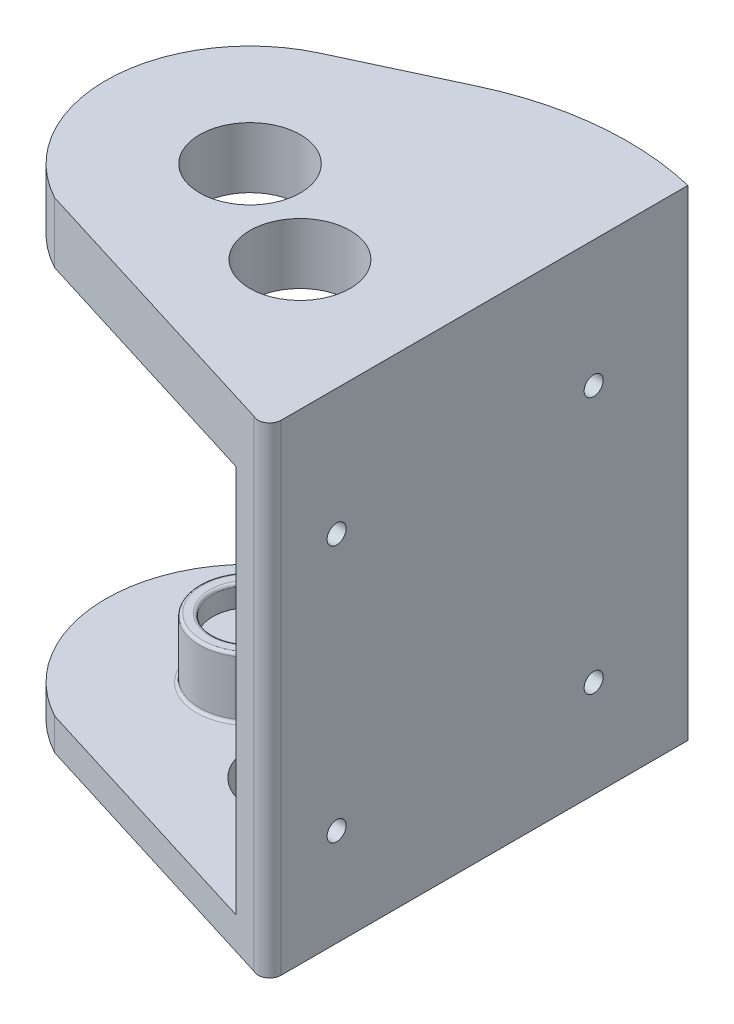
ISO-10303-21;
HEADER;
FILE_DESCRIPTION(('STEP AP214'),'2;1');
FILE_NAME('part.step','',(''),(''),'','','');
FILE_SCHEMA(('AUTOMOTIVE_DESIGN { 1 0 10303 214 1 1 1 1 }'));
ENDSEC;
DATA;
#1=APPLICATION_CONTEXT('core data for automotive mechanical design processes');
#2=APPLICATION_PROTOCOL_DEFINITION('international standard','automotive_design',2000,#1);
#3=PRODUCT_CONTEXT('',#1,'mechanical');
#4=PRODUCT('Part','Part','',(#3));
#5=PRODUCT_RELATED_PRODUCT_CATEGORY('part','',(#4));
#6=PRODUCT_DEFINITION_FORMATION('','',#4);
#7=PRODUCT_DEFINITION_CONTEXT('part definition',#1,'design');
#8=PRODUCT_DEFINITION('design','',#6,#7);
#9=PRODUCT_DEFINITION_SHAPE('','',#8);
#10=(LENGTH_UNIT() NAMED_UNIT(*) SI_UNIT(.MILLI.,.METRE.));
#11=(NAMED_UNIT(*) PLANE_ANGLE_UNIT() SI_UNIT($,.RADIAN.));
#12=(NAMED_UNIT(*) SI_UNIT($,.STERADIAN.) SOLID_ANGLE_UNIT());
#13=UNCERTAINTY_MEASURE_WITH_UNIT(LENGTH_MEASURE(1.E-05),#10,'distance_accuracy_value','');
#14=(GEOMETRIC_REPRESENTATION_CONTEXT(3) GLOBAL_UNCERTAINTY_ASSIGNED_CONTEXT((#13)) GLOBAL_UNIT_ASSIGNED_CONTEXT((#10,
#11,#12)) REPRESENTATION_CONTEXT('',''));
#15=CARTESIAN_POINT('',(0.,0.,0.));
#16=DIRECTION('',(0.,0.,1.));
#17=DIRECTION('',(1.,0.,0.));
#18=AXIS2_PLACEMENT_3D('',#15,#16,#17);
#19=CARTESIAN_POINT('',(13.625552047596,7.,5.40759066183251));
#20=DIRECTION('',(0.,-1.,0.));
#21=DIRECTION('',(0.,0.,-1.));
#22=AXIS2_PLACEMENT_3D('',#19,#20,#21);
#23=PLANE('',#22);
#24=CARTESIAN_POINT('',(0.,7.,0.));
#25=DIRECTION('',(0.,1.,0.));
#26=DIRECTION('',(0.,0.,1.));
#27=AXIS2_PLACEMENT_3D('',#24,#25,#26);
#28=CIRCLE('',#27,11.2395);
#29=CARTESIAN_POINT('',(0.,7.,11.2395));
#30=VERTEX_POINT('',#29);
#31=EDGE_CURVE('E353',#30,#30,#28,.T.);
#32=ORIENTED_EDGE('',*,*,#31,.F.);
#33=EDGE_LOOP('',(#32));
#34=FACE_BOUND('',#33,.T.);
#35=CARTESIAN_POINT('',(0.,7.,-23.8125));
#36=DIRECTION('',(0.,1.,0.));
#37=DIRECTION('',(0.,0.,1.));
#38=AXIS2_PLACEMENT_3D('',#35,#36,#37);
#39=CIRCLE('',#38,11.0998);
#40=CARTESIAN_POINT('',(0.,7.,-12.7127));
#41=VERTEX_POINT('',#40);
#42=EDGE_CURVE('E347',#41,#41,#39,.T.);
#43=ORIENTED_EDGE('',*,*,#42,.F.);
#44=EDGE_LOOP('',(#43));
#45=FACE_BOUND('',#44,.T.);
#46=CARTESIAN_POINT('',(0.,7.,-23.8125));
#47=DIRECTION('',(0.,-1.,0.));
#48=DIRECTION('',(0.,0.,-1.));
#49=AXIS2_PLACEMENT_3D('',#46,#47,#48);
#50=CIRCLE('',#49,16.129);
#51=CARTESIAN_POINT('',(-15.9700613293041,7.,-21.5537875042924));
#52=VERTEX_POINT('',#51);
#53=CARTESIAN_POINT('',(-11.995631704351,7.,-13.0305956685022));
#54=VERTEX_POINT('',#53);
#55=EDGE_CURVE('E222',#52,#54,#50,.F.);
#56=ORIENTED_EDGE('',*,*,#55,.T.);
#57=CARTESIAN_POINT('',(-23.7395995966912,7.,-12.7425429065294));
#58=DIRECTION('',(0.,-1.,0.));
#59=DIRECTION('',(0.,0.,-1.));
#60=AXIS2_PLACEMENT_3D('',#57,#58,#59);
#61=CIRCLE('',#60,11.7475);
#62=EDGE_CURVE('E396',#54,#52,#61,.T.);
#63=ORIENTED_EDGE('',*,*,#62,.T.);
#64=EDGE_LOOP('',(#56,#63));
#65=FACE_BOUND('',#64,.T.);
#66=DIRECTION('',(0.955132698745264,0.,0.296178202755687));
#67=VECTOR('',#66,1.);
#68=CARTESIAN_POINT('',(-38.7554237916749,7.,15.2322229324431));
#69=LINE('',#68,#67);
#70=CARTESIAN_POINT('',(-38.7554237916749,7.,15.2322229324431));
#71=VERTEX_POINT('',#70);
#72=CARTESIAN_POINT('',(19.05,7.,33.1571736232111));
#73=VERTEX_POINT('',#72);
#74=EDGE_CURVE('E176',#71,#73,#69,.T.);
#75=ORIENTED_EDGE('',*,*,#74,.T.);
#76=DIRECTION('',(0.,0.,1.));
#77=VECTOR('',#76,1.);
#78=CARTESIAN_POINT('',(19.05,7.,-46.2178263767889));
#79=LINE('',#78,#77);
#80=CARTESIAN_POINT('',(19.05,7.,-46.2178263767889));
#81=VERTEX_POINT('',#80);
#82=EDGE_CURVE('E174',#81,#73,#79,.T.);
#83=ORIENTED_EDGE('',*,*,#82,.F.);
#84=DIRECTION('',(0.955132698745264,0.,0.296178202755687));
#85=VECTOR('',#84,1.);
#86=CARTESIAN_POINT('',(5.66487809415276,7.,-50.3684343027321));
#87=LINE('',#86,#85);
#88=CARTESIAN_POINT('',(6.3500000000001,7.,-50.1559840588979));
#89=VERTEX_POINT('',#88);
#90=EDGE_CURVE('E166',#89,#81,#87,.T.);
#91=ORIENTED_EDGE('',*,*,#90,.F.);
#92=DIRECTION('',(0.,0.,-1.));
#93=VECTOR('',#92,1.);
#94=CARTESIAN_POINT('',(6.3500000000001,7.,-58.3528846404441));
#95=LINE('',#94,#93);
#96=CARTESIAN_POINT('',(6.3500000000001,7.,-58.1682631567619));
#97=VERTEX_POINT('',#96);
#98=EDGE_CURVE('E428',#89,#97,#95,.T.);
#99=ORIENTED_EDGE('',*,*,#98,.T.);
#100=CARTESIAN_POINT('',(13.625552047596,7.,5.40759066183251));
#101=DIRECTION('',(0.,1.,0.));
#102=DIRECTION('',(0.,0.,-1.));
#103=AXIS2_PLACEMENT_3D('',#100,#101,#102);
#104=CIRCLE('',#103,63.9908028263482);
#105=CARTESIAN_POINT('',(-13.4181298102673,7.,-52.5877722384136));
#106=VERTEX_POINT('',#105);
#107=EDGE_CURVE('E359',#97,#106,#104,.T.);
#108=ORIENTED_EDGE('',*,*,#107,.T.);
#109=DIRECTION('',(-0.906307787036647,0.,0.422618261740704));
#110=VECTOR('',#109,1.);
#111=CARTESIAN_POINT('',(-37.1577294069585,7.,-41.517815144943));
#112=LINE('',#111,#110);
#113=CARTESIAN_POINT('',(-37.1577294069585,7.,-41.517815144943));
#114=VERTEX_POINT('',#113);
#115=EDGE_CURVE('E361',#106,#114,#112,.T.);
#116=ORIENTED_EDGE('',*,*,#115,.T.);
#117=CARTESIAN_POINT('',(-23.7395995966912,7.,-12.7425429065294));
#118=DIRECTION('',(0.,1.,0.));
#119=DIRECTION('',(0.,0.,1.));
#120=AXIS2_PLACEMENT_3D('',#117,#118,#119);
#121=CIRCLE('',#120,31.75);
#122=EDGE_CURVE('E364',#114,#71,#121,.T.);
#123=ORIENTED_EDGE('',*,*,#122,.T.);
#124=EDGE_LOOP('',(#75,#83,#91,#99,#108,#116,#123));
#125=FACE_BOUND('',#124,.T.);
#126=ADVANCED_FACE('F37',(#34,#45,#65,#125),#23,.F.);
#127=CARTESIAN_POINT('',(13.625552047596,0.,5.40759066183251));
#128=DIRECTION('',(0.,-1.,0.));
#129=DIRECTION('',(0.,0.,-1.));
#130=AXIS2_PLACEMENT_3D('',#127,#128,#129);
#131=PLANE('',#130);
#132=CARTESIAN_POINT('',(21.59,0.,-31.8488616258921));
#133=DIRECTION('',(0.,-1.,0.));
#134=DIRECTION('',(0.,0.,-1.));
#135=AXIS2_PLACEMENT_3D('',#132,#133,#134);
#136=CIRCLE('',#135,3.175);
#137=CARTESIAN_POINT('',(21.59,0.,-35.0238616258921));
#138=VERTEX_POINT('',#137);
#139=EDGE_CURVE('E299',#138,#138,#136,.T.);
#140=ORIENTED_EDGE('',*,*,#139,.F.);
#141=EDGE_LOOP('',(#140));
#142=FACE_BOUND('',#141,.T.);
#143=CARTESIAN_POINT('',(21.59,0.,25.3011383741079));
#144=DIRECTION('',(0.,-1.,0.));
#145=DIRECTION('',(0.,0.,-1.));
#146=AXIS2_PLACEMENT_3D('',#143,#144,#145);
#147=CIRCLE('',#146,3.175);
#148=CARTESIAN_POINT('',(21.59,0.,22.1261383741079));
#149=VERTEX_POINT('',#148);
#150=EDGE_CURVE('E305',#149,#149,#147,.T.);
#151=ORIENTED_EDGE('',*,*,#150,.F.);
#152=EDGE_LOOP('',(#151));
#153=FACE_BOUND('',#152,.T.);
#154=CARTESIAN_POINT('',(-27.5071229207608,0.,-15.8962393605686));
#155=DIRECTION('',(0.,-1.,0.));
#156=DIRECTION('',(0.,0.,-1.));
#157=AXIS2_PLACEMENT_3D('',#154,#155,#156);
#158=CIRCLE('',#157,3.175);
#159=CARTESIAN_POINT('',(-27.5071229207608,0.,-19.0712393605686));
#160=VERTEX_POINT('',#159);
#161=EDGE_CURVE('E294',#160,#160,#158,.T.);
#162=ORIENTED_EDGE('',*,*,#161,.F.);
#163=EDGE_LOOP('',(#162));
#164=FACE_BOUND('',#163,.T.);
#165=CARTESIAN_POINT('',(13.625552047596,0.,5.40759066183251));
#166=DIRECTION('',(0.,1.,0.));
#167=DIRECTION('',(0.,0.,-1.));
#168=AXIS2_PLACEMENT_3D('',#165,#166,#167);
#169=CIRCLE('',#168,63.9908028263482);
#170=CARTESIAN_POINT('',(28.575,0.,-56.8124772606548));
#171=VERTEX_POINT('',#170);
#172=CARTESIAN_POINT('',(-13.4181298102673,0.,-52.5877722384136));
#173=VERTEX_POINT('',#172);
#174=EDGE_CURVE('E356',#171,#173,#169,.T.);
#175=ORIENTED_EDGE('',*,*,#174,.F.);
#176=DIRECTION('',(0.,0.,-1.));
#177=VECTOR('',#176,1.);
#178=CARTESIAN_POINT('',(28.575,0.,-43.65625));
#179=LINE('',#178,#177);
#180=CARTESIAN_POINT('',(28.575,0.,32.7126771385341));
#181=VERTEX_POINT('',#180);
#182=EDGE_CURVE('E362',#181,#171,#179,.T.);
#183=ORIENTED_EDGE('',*,*,#182,.F.);
#184=CARTESIAN_POINT('',(26.035,0.,32.7126771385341));
#185=DIRECTION('',(0.,1.,0.));
#186=DIRECTION('',(0.,0.,-1.));
#187=AXIS2_PLACEMENT_3D('',#184,#185,#186);
#188=CIRCLE('',#187,2.54);
#189=CARTESIAN_POINT('',(24.8337340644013,0.,34.9506584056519));
#190=VERTEX_POINT('',#189);
#191=EDGE_CURVE('E375',#190,#181,#188,.T.);
#192=ORIENTED_EDGE('',*,*,#191,.F.);
#193=DIRECTION('',(0.955132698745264,0.,0.296178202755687));
#194=VECTOR('',#193,1.);
#195=CARTESIAN_POINT('',(-38.7554237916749,0.,15.2322229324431));
#196=LINE('',#195,#194);
#197=CARTESIAN_POINT('',(-38.7554237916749,0.,15.2322229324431));
#198=VERTEX_POINT('',#197);
#199=EDGE_CURVE('E373',#198,#190,#196,.T.);
#200=ORIENTED_EDGE('',*,*,#199,.F.);
#201=CARTESIAN_POINT('',(-23.7395995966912,0.,-12.7425429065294));
#202=DIRECTION('',(0.,1.,0.));
#203=DIRECTION('',(0.,0.,1.));
#204=AXIS2_PLACEMENT_3D('',#201,#202,#203);
#205=CIRCLE('',#204,31.75);
#206=CARTESIAN_POINT('',(-37.1577294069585,0.,-41.517815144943));
#207=VERTEX_POINT('',#206);
#208=EDGE_CURVE('E371',#207,#198,#205,.T.);
#209=ORIENTED_EDGE('',*,*,#208,.F.);
#210=DIRECTION('',(-0.906307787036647,0.,0.422618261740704));
#211=VECTOR('',#210,1.);
#212=CARTESIAN_POINT('',(-37.1577294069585,0.,-41.517815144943));
#213=LINE('',#212,#211);
#214=EDGE_CURVE('E369',#173,#207,#213,.T.);
#215=ORIENTED_EDGE('',*,*,#214,.F.);
#216=EDGE_LOOP('',(#175,#183,#192,#200,#209,#215));
#217=FACE_BOUND('',#216,.T.);
#218=CARTESIAN_POINT('',(0.,0.,0.));
#219=DIRECTION('',(0.,1.,0.));
#220=DIRECTION('',(0.,0.,1.));
#221=AXIS2_PLACEMENT_3D('',#218,#219,#220);
#222=CIRCLE('',#221,11.2395);
#223=CARTESIAN_POINT('',(0.,0.,11.2395));
#224=VERTEX_POINT('',#223);
#225=EDGE_CURVE('E350',#224,#224,#222,.T.);
#226=ORIENTED_EDGE('',*,*,#225,.T.);
#227=EDGE_LOOP('',(#226));
#228=FACE_BOUND('',#227,.T.);
#229=CARTESIAN_POINT('',(0.,0.,-23.8125));
#230=DIRECTION('',(0.,1.,0.));
#231=DIRECTION('',(0.,0.,1.));
#232=AXIS2_PLACEMENT_3D('',#229,#230,#231);
#233=CIRCLE('',#232,11.0998);
#234=CARTESIAN_POINT('',(0.,0.,-12.7127));
#235=VERTEX_POINT('',#234);
#236=EDGE_CURVE('E346',#235,#235,#233,.T.);
#237=ORIENTED_EDGE('',*,*,#236,.T.);
#238=EDGE_LOOP('',(#237));
#239=FACE_BOUND('',#238,.T.);
#240=ADVANCED_FACE('F478',(#142,#153,#164,#217,#228,#239),#131,.T.);
#241=CARTESIAN_POINT('',(13.625552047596,7.,5.40759066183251));
#242=DIRECTION('',(0.,-1.,0.));
#243=DIRECTION('',(0.,0.,-1.));
#244=AXIS2_PLACEMENT_3D('',#241,#242,#243);
#245=CYLINDRICAL_SURFACE('',#244,63.9908028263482);
#246=ORIENTED_EDGE('',*,*,#174,.T.);
#247=DIRECTION('',(0.,-1.,0.));
#248=VECTOR('',#247,1.);
#249=CARTESIAN_POINT('',(-13.4181298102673,7.,-52.5877722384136));
#250=LINE('',#249,#248);
#251=EDGE_CURVE('E390',#106,#173,#250,.T.);
#252=ORIENTED_EDGE('',*,*,#251,.F.);
#253=ORIENTED_EDGE('',*,*,#107,.F.);
#254=CARTESIAN_POINT('',(13.625552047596,14.275552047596,5.40759066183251));
#255=DIRECTION('',(-0.707106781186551,0.707106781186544,0.));
#256=DIRECTION('',(-0.707106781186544,-0.707106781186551,0.));
#257=AXIS2_PLACEMENT_3D('',#254,#255,#256);
#258=ELLIPSE('',#257,90.4966612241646,63.9908028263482);
#259=CARTESIAN_POINT('',(19.05,19.7000000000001,-58.3528846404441));
#260=VERTEX_POINT('',#259);
#261=EDGE_CURVE('E46',#97,#260,#258,.F.);
#262=ORIENTED_EDGE('',*,*,#261,.T.);
#263=DIRECTION('',(0.,-1.,0.));
#264=VECTOR('',#263,1.);
#265=CARTESIAN_POINT('',(19.05,49.7228,-58.3528846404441));
#266=LINE('',#265,#264);
#267=CARTESIAN_POINT('',(19.05,79.7456,-58.3528846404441));
#268=VERTEX_POINT('',#267);
#269=EDGE_CURVE('E342',#268,#260,#266,.T.);
#270=ORIENTED_EDGE('',*,*,#269,.F.);
#271=CARTESIAN_POINT('',(13.625552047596,85.170047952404,5.40759066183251));
#272=DIRECTION('',(-0.707106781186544,-0.707106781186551,0.));
#273=DIRECTION('',(0.707106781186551,-0.707106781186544,0.));
#274=AXIS2_PLACEMENT_3D('',#271,#272,#273);
#275=ELLIPSE('',#274,90.4966612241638,63.9908028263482);
#276=CARTESIAN_POINT('',(6.34999999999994,92.4456,-58.1682631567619));
#277=VERTEX_POINT('',#276);
#278=EDGE_CURVE('E430',#268,#277,#275,.F.);
#279=ORIENTED_EDGE('',*,*,#278,.T.);
#280=CARTESIAN_POINT('',(13.625552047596,92.4456,5.40759066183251));
#281=DIRECTION('',(0.,1.,0.));
#282=DIRECTION('',(0.,0.,-1.));
#283=AXIS2_PLACEMENT_3D('',#280,#281,#282);
#284=CIRCLE('',#283,63.9908028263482);
#285=CARTESIAN_POINT('',(-13.4181298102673,92.4456,-52.5877722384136));
#286=VERTEX_POINT('',#285);
#287=EDGE_CURVE('E326',#277,#286,#284,.T.);
#288=ORIENTED_EDGE('',*,*,#287,.T.);
#289=DIRECTION('',(0.,1.,0.));
#290=VECTOR('',#289,1.);
#291=CARTESIAN_POINT('',(-13.4181298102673,92.4456,-52.5877722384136));
#292=LINE('',#291,#290);
#293=CARTESIAN_POINT('',(-13.4181298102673,105.7956,-52.5877722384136));
#294=VERTEX_POINT('',#293);
#295=EDGE_CURVE('E340',#286,#294,#292,.T.);
#296=ORIENTED_EDGE('',*,*,#295,.T.);
#297=CARTESIAN_POINT('',(13.625552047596,105.7956,5.40759066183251));
#298=DIRECTION('',(0.,1.,0.));
#299=DIRECTION('',(0.,0.,1.));
#300=AXIS2_PLACEMENT_3D('',#297,#298,#299);
#301=CIRCLE('',#300,63.9908028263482);
#302=CARTESIAN_POINT('',(28.575,105.7956,-56.8124772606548));
#303=VERTEX_POINT('',#302);
#304=EDGE_CURVE('E201',#303,#294,#301,.T.);
#305=ORIENTED_EDGE('',*,*,#304,.F.);
#306=DIRECTION('',(0.,-1.,0.));
#307=VECTOR('',#306,1.);
#308=CARTESIAN_POINT('',(28.575,7.,-56.8124772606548));
#309=LINE('',#308,#307);
#310=EDGE_CURVE('E393',#303,#171,#309,.T.);
#311=ORIENTED_EDGE('',*,*,#310,.T.);
#312=EDGE_LOOP('',(#246,#252,#253,#262,#270,#279,#288,#296,#305,#311));
#313=FACE_BOUND('',#312,.T.);
#314=ADVANCED_FACE('F435',(#313),#245,.T.);
#315=CARTESIAN_POINT('',(-37.1577294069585,7.,-41.517815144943));
#316=DIRECTION('',(0.422618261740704,0.,0.906307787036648));
#317=DIRECTION('',(0.906307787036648,0.,-0.422618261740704));
#318=AXIS2_PLACEMENT_3D('',#315,#316,#317);
#319=PLANE('',#318);
#320=ORIENTED_EDGE('',*,*,#214,.T.);
#321=DIRECTION('',(0.,-1.,0.));
#322=VECTOR('',#321,1.);
#323=CARTESIAN_POINT('',(-37.1577294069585,7.,-41.517815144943));
#324=LINE('',#323,#322);
#325=EDGE_CURVE('E387',#114,#207,#324,.T.);
#326=ORIENTED_EDGE('',*,*,#325,.F.);
#327=ORIENTED_EDGE('',*,*,#115,.F.);
#328=ORIENTED_EDGE('',*,*,#251,.T.);
#329=EDGE_LOOP('',(#320,#326,#327,#328));
#330=FACE_BOUND('',#329,.T.);
#331=ADVANCED_FACE('F446',(#330),#319,.F.);
#332=CARTESIAN_POINT('',(-23.7395995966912,7.,-12.7425429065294));
#333=DIRECTION('',(0.,-1.,0.));
#334=DIRECTION('',(0.,0.,-1.));
#335=AXIS2_PLACEMENT_3D('',#332,#333,#334);
#336=CYLINDRICAL_SURFACE('',#335,31.75);
#337=ORIENTED_EDGE('',*,*,#208,.T.);
#338=DIRECTION('',(0.,-1.,0.));
#339=VECTOR('',#338,1.);
#340=CARTESIAN_POINT('',(-38.7554237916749,7.,15.2322229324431));
#341=LINE('',#340,#339);
#342=EDGE_CURVE('E384',#71,#198,#341,.T.);
#343=ORIENTED_EDGE('',*,*,#342,.F.);
#344=ORIENTED_EDGE('',*,*,#122,.F.);
#345=ORIENTED_EDGE('',*,*,#325,.T.);
#346=EDGE_LOOP('',(#337,#343,#344,#345));
#347=FACE_BOUND('',#346,.T.);
#348=ADVANCED_FACE('F451',(#347),#336,.T.);
#349=CARTESIAN_POINT('',(-38.7554237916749,7.,15.2322229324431));
#350=DIRECTION('',(0.296178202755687,0.,-0.955132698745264));
#351=DIRECTION('',(-0.955132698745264,0.,-0.296178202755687));
#352=AXIS2_PLACEMENT_3D('',#349,#350,#351);
#353=PLANE('',#352);
#354=DIRECTION('',(0.955132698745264,0.,0.296178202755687));
#355=VECTOR('',#354,1.);
#356=CARTESIAN_POINT('',(-38.7554237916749,92.4456,15.2322229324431));
#357=LINE('',#356,#355);
#358=CARTESIAN_POINT('',(-38.7554237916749,92.4456,15.2322229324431));
#359=VERTEX_POINT('',#358);
#360=CARTESIAN_POINT('',(19.05,92.4456,33.1571736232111));
#361=VERTEX_POINT('',#360);
#362=EDGE_CURVE('E334',#359,#361,#357,.T.);
#363=ORIENTED_EDGE('',*,*,#362,.T.);
#364=DIRECTION('',(0.,-1.,0.));
#365=VECTOR('',#364,1.);
#366=CARTESIAN_POINT('',(19.05,49.7228,33.1571736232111));
#367=LINE('',#366,#365);
#368=EDGE_CURVE('E344',#361,#73,#367,.T.);
#369=ORIENTED_EDGE('',*,*,#368,.T.);
#370=ORIENTED_EDGE('',*,*,#74,.F.);
#371=ORIENTED_EDGE('',*,*,#342,.T.);
#372=ORIENTED_EDGE('',*,*,#199,.T.);
#373=DIRECTION('',(0.,-1.,0.));
#374=VECTOR('',#373,1.);
#375=CARTESIAN_POINT('',(24.8337340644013,7.,34.9506584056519));
#376=LINE('',#375,#374);
#377=CARTESIAN_POINT('',(24.8337340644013,105.7956,34.9506584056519));
#378=VERTEX_POINT('',#377);
#379=EDGE_CURVE('E381',#378,#190,#376,.T.);
#380=ORIENTED_EDGE('',*,*,#379,.F.);
#381=DIRECTION('',(0.955132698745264,0.,0.296178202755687));
#382=VECTOR('',#381,1.);
#383=CARTESIAN_POINT('',(-38.7554237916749,105.7956,15.2322229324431));
#384=LINE('',#383,#382);
#385=CARTESIAN_POINT('',(-38.7554237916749,105.7956,15.2322229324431));
#386=VERTEX_POINT('',#385);
#387=EDGE_CURVE('E210',#386,#378,#384,.T.);
#388=ORIENTED_EDGE('',*,*,#387,.F.);
#389=DIRECTION('',(0.,1.,0.));
#390=VECTOR('',#389,1.);
#391=CARTESIAN_POINT('',(-38.7554237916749,92.4456,15.2322229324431));
#392=LINE('',#391,#390);
#393=EDGE_CURVE('E336',#359,#386,#392,.T.);
#394=ORIENTED_EDGE('',*,*,#393,.F.);
#395=EDGE_LOOP('',(#363,#369,#370,#371,#372,#380,#388,#394));
#396=FACE_BOUND('',#395,.T.);
#397=ADVANCED_FACE('F454',(#396),#353,.F.);
#398=CARTESIAN_POINT('',(26.035,7.,32.7126771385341));
#399=DIRECTION('',(0.,-1.,0.));
#400=DIRECTION('',(0.,0.,-1.));
#401=AXIS2_PLACEMENT_3D('',#398,#399,#400);
#402=CYLINDRICAL_SURFACE('',#401,2.54);
#403=ORIENTED_EDGE('',*,*,#191,.T.);
#404=DIRECTION('',(0.,-1.,0.));
#405=VECTOR('',#404,1.);
#406=CARTESIAN_POINT('',(28.575,7.,32.7126771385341));
#407=LINE('',#406,#405);
#408=CARTESIAN_POINT('',(28.575,105.7956,32.7126771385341));
#409=VERTEX_POINT('',#408);
#410=EDGE_CURVE('E367',#409,#181,#407,.T.);
#411=ORIENTED_EDGE('',*,*,#410,.F.);
#412=CARTESIAN_POINT('',(26.035,105.7956,32.7126771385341));
#413=DIRECTION('',(0.,1.,0.));
#414=DIRECTION('',(0.,0.,1.));
#415=AXIS2_PLACEMENT_3D('',#412,#413,#414);
#416=CIRCLE('',#415,2.54);
#417=EDGE_CURVE('E213',#378,#409,#416,.T.);
#418=ORIENTED_EDGE('',*,*,#417,.F.);
#419=ORIENTED_EDGE('',*,*,#379,.T.);
#420=EDGE_LOOP('',(#403,#411,#418,#419));
#421=FACE_BOUND('',#420,.T.);
#422=ADVANCED_FACE('F495',(#421),#402,.T.);
#423=CARTESIAN_POINT('',(28.575,7.,-43.65625));
#424=DIRECTION('',(-1.,0.,0.));
#425=DIRECTION('',(0.,0.,1.));
#426=AXIS2_PLACEMENT_3D('',#423,#424,#425);
#427=PLANE('',#426);
#428=CARTESIAN_POINT('',(28.575,21.43482,-36.0705643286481));
#429=DIRECTION('',(-1.,0.,0.));
#430=DIRECTION('',(0.,0.,1.));
#431=AXIS2_PLACEMENT_3D('',#428,#429,#430);
#432=CIRCLE('',#431,2.0955);
#433=CARTESIAN_POINT('',(28.575,21.43482,-33.9750643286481));
#434=VERTEX_POINT('',#433);
#435=EDGE_CURVE('E280',#434,#434,#432,.F.);
#436=ORIENTED_EDGE('',*,*,#435,.F.);
#437=EDGE_LOOP('',(#436));
#438=FACE_BOUND('',#437,.T.);
#439=CARTESIAN_POINT('',(28.575,78.01078,20.5053956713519));
#440=DIRECTION('',(-1.,0.,0.));
#441=DIRECTION('',(0.,0.,1.));
#442=AXIS2_PLACEMENT_3D('',#439,#440,#441);
#443=CIRCLE('',#442,2.0955);
#444=CARTESIAN_POINT('',(28.575,78.01078,22.6008956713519));
#445=VERTEX_POINT('',#444);
#446=EDGE_CURVE('E281',#445,#445,#443,.F.);
#447=ORIENTED_EDGE('',*,*,#446,.F.);
#448=EDGE_LOOP('',(#447));
#449=FACE_BOUND('',#448,.T.);
#450=CARTESIAN_POINT('',(28.575,21.43482,20.5053956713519));
#451=DIRECTION('',(-1.,0.,0.));
#452=DIRECTION('',(0.,0.,1.));
#453=AXIS2_PLACEMENT_3D('',#450,#451,#452);
#454=CIRCLE('',#453,2.0955);
#455=CARTESIAN_POINT('',(28.575,21.43482,22.6008956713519));
#456=VERTEX_POINT('',#455);
#457=EDGE_CURVE('E273',#456,#456,#454,.F.);
#458=ORIENTED_EDGE('',*,*,#457,.F.);
#459=EDGE_LOOP('',(#458));
#460=FACE_BOUND('',#459,.T.);
#461=CARTESIAN_POINT('',(28.575,78.01078,-36.0705643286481));
#462=DIRECTION('',(-1.,0.,0.));
#463=DIRECTION('',(0.,0.,1.));
#464=AXIS2_PLACEMENT_3D('',#461,#462,#463);
#465=CIRCLE('',#464,2.0955);
#466=CARTESIAN_POINT('',(28.575,78.01078,-33.9750643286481));
#467=VERTEX_POINT('',#466);
#468=EDGE_CURVE('E291',#467,#467,#465,.F.);
#469=ORIENTED_EDGE('',*,*,#468,.F.);
#470=EDGE_LOOP('',(#469));
#471=FACE_BOUND('',#470,.T.);
#472=ORIENTED_EDGE('',*,*,#182,.T.);
#473=ORIENTED_EDGE('',*,*,#310,.F.);
#474=DIRECTION('',(0.,0.,-1.));
#475=VECTOR('',#474,1.);
#476=CARTESIAN_POINT('',(28.575,105.7956,32.7126771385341));
#477=LINE('',#476,#475);
#478=EDGE_CURVE('E216',#409,#303,#477,.T.);
#479=ORIENTED_EDGE('',*,*,#478,.F.);
#480=ORIENTED_EDGE('',*,*,#410,.T.);
#481=EDGE_LOOP('',(#472,#473,#479,#480));
#482=FACE_BOUND('',#481,.T.);
#483=ADVANCED_FACE('F492',(#438,#449,#460,#471,#482),#427,.F.);
#484=CARTESIAN_POINT('',(0.,7.,0.));
#485=DIRECTION('',(0.,-1.,0.));
#486=DIRECTION('',(0.,0.,-1.));
#487=AXIS2_PLACEMENT_3D('',#484,#485,#486);
#488=CYLINDRICAL_SURFACE('',#487,11.2395);
#489=ORIENTED_EDGE('',*,*,#31,.T.);
#490=EDGE_LOOP('',(#489));
#491=FACE_BOUND('',#490,.T.);
#492=ORIENTED_EDGE('',*,*,#225,.F.);
#493=EDGE_LOOP('',(#492));
#494=FACE_BOUND('',#493,.T.);
#495=ADVANCED_FACE('F489',(#491,#494),#488,.F.);
#496=CARTESIAN_POINT('',(0.,7.,-23.8125));
#497=DIRECTION('',(0.,-1.,0.));
#498=DIRECTION('',(0.,0.,-1.));
#499=AXIS2_PLACEMENT_3D('',#496,#497,#498);
#500=CYLINDRICAL_SURFACE('',#499,11.0998);
#501=ORIENTED_EDGE('',*,*,#42,.T.);
#502=EDGE_LOOP('',(#501));
#503=FACE_BOUND('',#502,.T.);
#504=ORIENTED_EDGE('',*,*,#236,.F.);
#505=EDGE_LOOP('',(#504));
#506=FACE_BOUND('',#505,.T.);
#507=ADVANCED_FACE('F543',(#503,#506),#500,.F.);
#508=CARTESIAN_POINT('',(19.05,49.7228,0.));
#509=DIRECTION('',(1.,0.,0.));
#510=DIRECTION('',(0.,0.,-1.));
#511=AXIS2_PLACEMENT_3D('',#508,#509,#510);
#512=PLANE('',#511);
#513=DIRECTION('',(0.,0.,1.));
#514=VECTOR('',#513,1.);
#515=CARTESIAN_POINT('',(19.05,19.7000000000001,33.1571736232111));
#516=LINE('',#515,#514);
#517=CARTESIAN_POINT('',(19.05,19.7000000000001,-46.2178263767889));
#518=VERTEX_POINT('',#517);
#519=EDGE_CURVE('E187',#260,#518,#516,.T.);
#520=ORIENTED_EDGE('',*,*,#519,.T.);
#521=DIRECTION('',(0.,1.,0.));
#522=VECTOR('',#521,1.);
#523=CARTESIAN_POINT('',(19.05,7.,-46.2178263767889));
#524=LINE('',#523,#522);
#525=EDGE_CURVE('E61',#81,#518,#524,.T.);
#526=ORIENTED_EDGE('',*,*,#525,.F.);
#527=ORIENTED_EDGE('',*,*,#82,.T.);
#528=ORIENTED_EDGE('',*,*,#368,.F.);
#529=DIRECTION('',(0.,0.,1.));
#530=VECTOR('',#529,1.);
#531=CARTESIAN_POINT('',(19.05,92.4456,-46.2178263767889));
#532=LINE('',#531,#530);
#533=CARTESIAN_POINT('',(19.05,92.4456,-46.2178263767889));
#534=VERTEX_POINT('',#533);
#535=EDGE_CURVE('E180',#534,#361,#532,.T.);
#536=ORIENTED_EDGE('',*,*,#535,.F.);
#537=CARTESIAN_POINT('',(19.05,79.7456000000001,-46.2178263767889));
#538=VERTEX_POINT('',#537);
#539=EDGE_CURVE('E171',#538,#534,#524,.T.);
#540=ORIENTED_EDGE('',*,*,#539,.F.);
#541=DIRECTION('',(0.,0.,-1.));
#542=VECTOR('',#541,1.);
#543=CARTESIAN_POINT('',(19.05,79.7456,-58.3528846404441));
#544=LINE('',#543,#542);
#545=EDGE_CURVE('E424',#538,#268,#544,.T.);
#546=ORIENTED_EDGE('',*,*,#545,.T.);
#547=ORIENTED_EDGE('',*,*,#269,.T.);
#548=EDGE_LOOP('',(#520,#526,#527,#528,#536,#540,#546,#547));
#549=FACE_BOUND('',#548,.T.);
#550=CARTESIAN_POINT('',(19.05,78.01078,20.5053956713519));
#551=DIRECTION('',(-1.,0.,0.));
#552=DIRECTION('',(0.,0.,1.));
#553=AXIS2_PLACEMENT_3D('',#550,#551,#552);
#554=CIRCLE('',#553,2.0955);
#555=CARTESIAN_POINT('',(19.05,78.01078,22.6008956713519));
#556=VERTEX_POINT('',#555);
#557=EDGE_CURVE('E276',#556,#556,#554,.T.);
#558=ORIENTED_EDGE('',*,*,#557,.F.);
#559=EDGE_LOOP('',(#558));
#560=FACE_BOUND('',#559,.T.);
#561=CARTESIAN_POINT('',(19.05,78.01078,-36.0705643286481));
#562=DIRECTION('',(-1.,0.,0.));
#563=DIRECTION('',(0.,0.,1.));
#564=AXIS2_PLACEMENT_3D('',#561,#562,#563);
#565=CIRCLE('',#564,2.0955);
#566=CARTESIAN_POINT('',(19.05,78.01078,-33.9750643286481));
#567=VERTEX_POINT('',#566);
#568=EDGE_CURVE('E284',#567,#567,#565,.T.);
#569=ORIENTED_EDGE('',*,*,#568,.F.);
#570=EDGE_LOOP('',(#569));
#571=FACE_BOUND('',#570,.T.);
#572=CARTESIAN_POINT('',(19.05,21.43482,-36.0705643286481));
#573=DIRECTION('',(-1.,0.,0.));
#574=DIRECTION('',(0.,0.,1.));
#575=AXIS2_PLACEMENT_3D('',#572,#573,#574);
#576=CIRCLE('',#575,2.0955);
#577=CARTESIAN_POINT('',(19.05,21.43482,-33.9750643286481));
#578=VERTEX_POINT('',#577);
#579=EDGE_CURVE('E277',#578,#578,#576,.T.);
#580=ORIENTED_EDGE('',*,*,#579,.F.);
#581=EDGE_LOOP('',(#580));
#582=FACE_BOUND('',#581,.T.);
#583=CARTESIAN_POINT('',(19.05,21.43482,20.5053956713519));
#584=DIRECTION('',(-1.,0.,0.));
#585=DIRECTION('',(0.,0.,1.));
#586=AXIS2_PLACEMENT_3D('',#583,#584,#585);
#587=CIRCLE('',#586,2.0955);
#588=CARTESIAN_POINT('',(19.05,21.43482,22.6008956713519));
#589=VERTEX_POINT('',#588);
#590=EDGE_CURVE('E270',#589,#589,#587,.T.);
#591=ORIENTED_EDGE('',*,*,#590,.F.);
#592=EDGE_LOOP('',(#591));
#593=FACE_BOUND('',#592,.T.);
#594=ADVANCED_FACE('F183',(#549,#560,#571,#582,#593),#512,.F.);
#595=CARTESIAN_POINT('',(13.625552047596,92.4456,5.40759066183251));
#596=DIRECTION('',(0.,1.,0.));
#597=DIRECTION('',(0.,0.,-1.));
#598=AXIS2_PLACEMENT_3D('',#595,#596,#597);
#599=PLANE('',#598);
#600=CARTESIAN_POINT('',(0.,92.4456,-23.8125));
#601=DIRECTION('',(0.,1.,0.));
#602=DIRECTION('',(0.,0.,1.));
#603=AXIS2_PLACEMENT_3D('',#600,#601,#602);
#604=CIRCLE('',#603,11.0998);
#605=CARTESIAN_POINT('',(0.,92.4456,-12.7127));
#606=VERTEX_POINT('',#605);
#607=EDGE_CURVE('E318',#606,#606,#604,.T.);
#608=ORIENTED_EDGE('',*,*,#607,.T.);
#609=EDGE_LOOP('',(#608));
#610=FACE_BOUND('',#609,.T.);
#611=CARTESIAN_POINT('',(0.,92.4456,0.));
#612=DIRECTION('',(0.,1.,0.));
#613=DIRECTION('',(0.,0.,1.));
#614=AXIS2_PLACEMENT_3D('',#611,#612,#613);
#615=CIRCLE('',#614,11.049);
#616=CARTESIAN_POINT('',(0.,92.4456,11.049));
#617=VERTEX_POINT('',#616);
#618=EDGE_CURVE('E298',#617,#617,#615,.F.);
#619=ORIENTED_EDGE('',*,*,#618,.F.);
#620=EDGE_LOOP('',(#619));
#621=FACE_BOUND('',#620,.T.);
#622=ORIENTED_EDGE('',*,*,#535,.T.);
#623=ORIENTED_EDGE('',*,*,#362,.F.);
#624=CARTESIAN_POINT('',(-23.7395995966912,92.4456,-12.7425429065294));
#625=DIRECTION('',(0.,1.,0.));
#626=DIRECTION('',(0.,0.,1.));
#627=AXIS2_PLACEMENT_3D('',#624,#625,#626);
#628=CIRCLE('',#627,31.75);
#629=CARTESIAN_POINT('',(-37.1577294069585,92.4456,-41.517815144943));
#630=VERTEX_POINT('',#629);
#631=EDGE_CURVE('E331',#630,#359,#628,.T.);
#632=ORIENTED_EDGE('',*,*,#631,.F.);
#633=DIRECTION('',(-0.906307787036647,0.,0.422618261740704));
#634=VECTOR('',#633,1.);
#635=CARTESIAN_POINT('',(-37.1577294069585,92.4456,-41.517815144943));
#636=LINE('',#635,#634);
#637=EDGE_CURVE('E328',#286,#630,#636,.T.);
#638=ORIENTED_EDGE('',*,*,#637,.F.);
#639=ORIENTED_EDGE('',*,*,#287,.F.);
#640=DIRECTION('',(0.,0.,1.));
#641=VECTOR('',#640,1.);
#642=CARTESIAN_POINT('',(6.34999999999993,92.4456,33.1571736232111));
#643=LINE('',#642,#641);
#644=CARTESIAN_POINT('',(6.34999999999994,92.4456,-50.155984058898));
#645=VERTEX_POINT('',#644);
#646=EDGE_CURVE('E417',#277,#645,#643,.T.);
#647=ORIENTED_EDGE('',*,*,#646,.T.);
#648=DIRECTION('',(-0.955132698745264,0.,-0.296178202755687));
#649=VECTOR('',#648,1.);
#650=CARTESIAN_POINT('',(5.66487809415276,92.4456,-50.3684343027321));
#651=LINE('',#650,#649);
#652=EDGE_CURVE('E53',#534,#645,#651,.T.);
#653=ORIENTED_EDGE('',*,*,#652,.F.);
#654=EDGE_LOOP('',(#622,#623,#632,#638,#639,#647,#653));
#655=FACE_BOUND('',#654,.T.);
#656=CARTESIAN_POINT('',(-23.7395995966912,92.4456,-12.7425429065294));
#657=DIRECTION('',(0.,1.,0.));
#658=DIRECTION('',(0.,0.,1.));
#659=AXIS2_PLACEMENT_3D('',#656,#657,#658);
#660=CIRCLE('',#659,11.0998);
#661=CARTESIAN_POINT('',(-23.7395995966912,92.4456,-1.64274290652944));
#662=VERTEX_POINT('',#661);
#663=EDGE_CURVE('E321',#662,#662,#660,.T.);
#664=ORIENTED_EDGE('',*,*,#663,.T.);
#665=EDGE_LOOP('',(#664));
#666=FACE_BOUND('',#665,.T.);
#667=ADVANCED_FACE('F457',(#610,#621,#655,#666),#599,.F.);
#668=CARTESIAN_POINT('',(-37.1577294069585,92.4456,-41.517815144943));
#669=DIRECTION('',(0.422618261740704,0.,0.906307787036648));
#670=DIRECTION('',(0.906307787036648,0.,-0.422618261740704));
#671=AXIS2_PLACEMENT_3D('',#668,#669,#670);
#672=PLANE('',#671);
#673=DIRECTION('',(0.,1.,0.));
#674=VECTOR('',#673,1.);
#675=CARTESIAN_POINT('',(-37.1577294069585,92.4456,-41.517815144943));
#676=LINE('',#675,#674);
#677=CARTESIAN_POINT('',(-37.1577294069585,105.7956,-41.517815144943));
#678=VERTEX_POINT('',#677);
#679=EDGE_CURVE('E338',#630,#678,#676,.T.);
#680=ORIENTED_EDGE('',*,*,#679,.T.);
#681=DIRECTION('',(-0.906307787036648,0.,0.422618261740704));
#682=VECTOR('',#681,1.);
#683=CARTESIAN_POINT('',(-13.4181298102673,105.7956,-52.5877722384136));
#684=LINE('',#683,#682);
#685=EDGE_CURVE('E204',#294,#678,#684,.T.);
#686=ORIENTED_EDGE('',*,*,#685,.F.);
#687=ORIENTED_EDGE('',*,*,#295,.F.);
#688=ORIENTED_EDGE('',*,*,#637,.T.);
#689=EDGE_LOOP('',(#680,#686,#687,#688));
#690=FACE_BOUND('',#689,.T.);
#691=ADVANCED_FACE('F467',(#690),#672,.F.);
#692=CARTESIAN_POINT('',(-23.7395995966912,92.4456,-12.7425429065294));
#693=DIRECTION('',(0.,1.,0.));
#694=DIRECTION('',(0.,0.,-1.));
#695=AXIS2_PLACEMENT_3D('',#692,#693,#694);
#696=CYLINDRICAL_SURFACE('',#695,31.75);
#697=ORIENTED_EDGE('',*,*,#393,.T.);
#698=CARTESIAN_POINT('',(-23.7395995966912,105.7956,-12.7425429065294));
#699=DIRECTION('',(0.,1.,0.));
#700=DIRECTION('',(0.,0.,1.));
#701=AXIS2_PLACEMENT_3D('',#698,#699,#700);
#702=CIRCLE('',#701,31.75);
#703=EDGE_CURVE('E207',#678,#386,#702,.T.);
#704=ORIENTED_EDGE('',*,*,#703,.F.);
#705=ORIENTED_EDGE('',*,*,#679,.F.);
#706=ORIENTED_EDGE('',*,*,#631,.T.);
#707=EDGE_LOOP('',(#697,#704,#705,#706));
#708=FACE_BOUND('',#707,.T.);
#709=ADVANCED_FACE('F462',(#708),#696,.T.);
#710=CARTESIAN_POINT('',(-23.7395995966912,92.4456,-12.7425429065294));
#711=DIRECTION('',(0.,1.,0.));
#712=DIRECTION('',(0.,0.,-1.));
#713=AXIS2_PLACEMENT_3D('',#710,#711,#712);
#714=CYLINDRICAL_SURFACE('',#713,11.0998);
#715=ORIENTED_EDGE('',*,*,#663,.F.);
#716=EDGE_LOOP('',(#715));
#717=FACE_BOUND('',#716,.T.);
#718=CARTESIAN_POINT('',(-23.7395995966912,105.7956,-12.7425429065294));
#719=DIRECTION('',(0.,1.,0.));
#720=DIRECTION('',(0.,0.,1.));
#721=AXIS2_PLACEMENT_3D('',#718,#719,#720);
#722=CIRCLE('',#721,11.0998);
#723=CARTESIAN_POINT('',(-23.7395995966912,105.7956,-1.64274290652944));
#724=VERTEX_POINT('',#723);
#725=EDGE_CURVE('E198',#724,#724,#722,.T.);
#726=ORIENTED_EDGE('',*,*,#725,.T.);
#727=EDGE_LOOP('',(#726));
#728=FACE_BOUND('',#727,.T.);
#729=ADVANCED_FACE('F575',(#717,#728),#714,.F.);
#730=CARTESIAN_POINT('',(0.,92.4456,-23.8125));
#731=DIRECTION('',(0.,1.,0.));
#732=DIRECTION('',(0.,0.,-1.));
#733=AXIS2_PLACEMENT_3D('',#730,#731,#732);
#734=CYLINDRICAL_SURFACE('',#733,11.0998);
#735=ORIENTED_EDGE('',*,*,#607,.F.);
#736=EDGE_LOOP('',(#735));
#737=FACE_BOUND('',#736,.T.);
#738=CARTESIAN_POINT('',(0.,99.4456,-23.8125));
#739=DIRECTION('',(0.,1.,0.));
#740=DIRECTION('',(0.,0.,1.));
#741=AXIS2_PLACEMENT_3D('',#738,#739,#740);
#742=CIRCLE('',#741,11.0998);
#743=CARTESIAN_POINT('',(0.,99.4456,-12.7127));
#744=VERTEX_POINT('',#743);
#745=EDGE_CURVE('E219',#744,#744,#742,.T.);
#746=ORIENTED_EDGE('',*,*,#745,.T.);
#747=EDGE_LOOP('',(#746));
#748=FACE_BOUND('',#747,.T.);
#749=ADVANCED_FACE('F582',(#737,#748),#734,.F.);
#750=CARTESIAN_POINT('',(-23.7395995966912,20.208,-12.7425429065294));
#751=DIRECTION('',(0.,-1.,0.));
#752=DIRECTION('',(0.,0.,-1.));
#753=AXIS2_PLACEMENT_3D('',#750,#751,#752);
#754=CYLINDRICAL_SURFACE('',#753,11.1125);
#755=DIRECTION('',(0.,1.,0.));
#756=VECTOR('',#755,1.);
#757=CARTESIAN_POINT('',(-12.682136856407,13.604,-13.8471577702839));
#758=LINE('',#757,#756);
#759=CARTESIAN_POINT('',(-12.682136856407,19.573,-13.8471577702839));
#760=VERTEX_POINT('',#759);
#761=CARTESIAN_POINT('',(-12.682136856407,7.635,-13.8471577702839));
#762=VERTEX_POINT('',#761);
#763=EDGE_CURVE('E225',#760,#762,#758,.F.);
#764=ORIENTED_EDGE('',*,*,#763,.F.);
#765=CARTESIAN_POINT('',(-23.7395995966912,19.573,-12.7425429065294));
#766=DIRECTION('',(0.,-1.,0.));
#767=DIRECTION('',(0.,0.,-1.));
#768=AXIS2_PLACEMENT_3D('',#765,#766,#767);
#769=CIRCLE('',#768,11.1125);
#770=CARTESIAN_POINT('',(-15.7858154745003,19.573,-20.5030180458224));
#771=VERTEX_POINT('',#770);
#772=EDGE_CURVE('E399',#760,#771,#769,.T.);
#773=ORIENTED_EDGE('',*,*,#772,.T.);
#774=DIRECTION('',(0.,1.,0.));
#775=VECTOR('',#774,1.);
#776=CARTESIAN_POINT('',(-15.7858154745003,13.604,-20.5030180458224));
#777=LINE('',#776,#775);
#778=CARTESIAN_POINT('',(-15.7858154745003,7.635,-20.5030180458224));
#779=VERTEX_POINT('',#778);
#780=EDGE_CURVE('E236',#779,#771,#777,.T.);
#781=ORIENTED_EDGE('',*,*,#780,.F.);
#782=CARTESIAN_POINT('',(-23.7395995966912,7.635,-12.7425429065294));
#783=DIRECTION('',(0.,-1.,0.));
#784=DIRECTION('',(0.,0.,-1.));
#785=AXIS2_PLACEMENT_3D('',#782,#783,#784);
#786=CIRCLE('',#785,11.1125);
#787=EDGE_CURVE('E402',#779,#762,#786,.F.);
#788=ORIENTED_EDGE('',*,*,#787,.T.);
#789=EDGE_LOOP('',(#764,#773,#781,#788));
#790=FACE_BOUND('',#789,.T.);
#791=ADVANCED_FACE('F590',(#790),#754,.T.);
#792=CARTESIAN_POINT('',(-23.7395995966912,20.208,-12.7425429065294));
#793=DIRECTION('',(0.,-1.,0.));
#794=DIRECTION('',(0.,0.,-1.));
#795=AXIS2_PLACEMENT_3D('',#792,#793,#794);
#796=PLANE('',#795);
#797=CARTESIAN_POINT('',(-23.7395995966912,20.208,-12.7425429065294));
#798=DIRECTION('',(0.,-1.,0.));
#799=DIRECTION('',(0.,0.,-1.));
#800=AXIS2_PLACEMENT_3D('',#797,#798,#799);
#801=CIRCLE('',#800,10.4775);
#802=CARTESIAN_POINT('',(-15.4343807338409,20.208,-19.1301360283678));
#803=VERTEX_POINT('',#802);
#804=CARTESIAN_POINT('',(-13.5079276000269,20.208,-14.9988439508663));
#805=VERTEX_POINT('',#804);
#806=EDGE_CURVE('E408',#803,#805,#801,.F.);
#807=ORIENTED_EDGE('',*,*,#806,.T.);
#808=CARTESIAN_POINT('',(0.,20.208,-23.8125));
#809=DIRECTION('',(0.,1.,0.));
#810=DIRECTION('',(0.,0.,1.));
#811=AXIS2_PLACEMENT_3D('',#808,#809,#810);
#812=CIRCLE('',#811,16.129);
#813=EDGE_CURVE('E220',#803,#805,#812,.T.);
#814=ORIENTED_EDGE('',*,*,#813,.F.);
#815=EDGE_LOOP('',(#807,#814));
#816=FACE_BOUND('',#815,.T.);
#817=CARTESIAN_POINT('',(-23.739599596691,20.208,-12.7425429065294));
#818=DIRECTION('',(0.,-1.,0.));
#819=DIRECTION('',(0.,0.,-1.));
#820=AXIS2_PLACEMENT_3D('',#817,#818,#819);
#821=CIRCLE('',#820,8.8265);
#822=CARTESIAN_POINT('',(-23.739599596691,20.208,-21.5690429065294));
#823=VERTEX_POINT('',#822);
#824=EDGE_CURVE('E405',#823,#823,#821,.T.);
#825=ORIENTED_EDGE('',*,*,#824,.T.);
#826=EDGE_LOOP('',(#825));
#827=FACE_BOUND('',#826,.T.);
#828=ADVANCED_FACE('F599',(#816,#827),#796,.F.);
#829=CARTESIAN_POINT('',(-23.739599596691,15.382,-12.7425429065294));
#830=DIRECTION('',(0.,1.,0.));
#831=DIRECTION('',(0.,0.,1.));
#832=AXIS2_PLACEMENT_3D('',#829,#830,#831);
#833=CYLINDRICAL_SURFACE('',#832,8.1915);
#834=CARTESIAN_POINT('',(-23.739599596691,19.573,-12.7425429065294));
#835=DIRECTION('',(0.,-1.,0.));
#836=DIRECTION('',(0.,0.,-1.));
#837=AXIS2_PLACEMENT_3D('',#834,#835,#836);
#838=CIRCLE('',#837,8.1915);
#839=CARTESIAN_POINT('',(-23.739599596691,19.573,-20.9340429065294));
#840=VERTEX_POINT('',#839);
#841=EDGE_CURVE('E410',#840,#840,#838,.F.);
#842=ORIENTED_EDGE('',*,*,#841,.T.);
#843=EDGE_LOOP('',(#842));
#844=FACE_BOUND('',#843,.T.);
#845=CARTESIAN_POINT('',(-23.739599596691,15.382,-12.7425429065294));
#846=DIRECTION('',(0.,1.,0.));
#847=DIRECTION('',(0.,0.,1.));
#848=AXIS2_PLACEMENT_3D('',#845,#846,#847);
#849=CIRCLE('',#848,8.1915);
#850=CARTESIAN_POINT('',(-23.739599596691,15.382,-4.55104290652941));
#851=VERTEX_POINT('',#850);
#852=EDGE_CURVE('E315',#851,#851,#849,.T.);
#853=ORIENTED_EDGE('',*,*,#852,.F.);
#854=EDGE_LOOP('',(#853));
#855=FACE_BOUND('',#854,.T.);
#856=ADVANCED_FACE('F608',(#844,#855),#833,.F.);
#857=CARTESIAN_POINT('',(-23.739599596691,15.382,-12.7425429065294));
#858=DIRECTION('',(0.,1.,0.));
#859=DIRECTION('',(0.,0.,1.));
#860=AXIS2_PLACEMENT_3D('',#857,#858,#859);
#861=PLANE('',#860);
#862=ORIENTED_EDGE('',*,*,#852,.T.);
#863=EDGE_LOOP('',(#862));
#864=FACE_BOUND('',#863,.T.);
#865=ADVANCED_FACE('F617',(#864),#861,.T.);
#866=CARTESIAN_POINT('',(-23.7395995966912,7.635,-12.7425429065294));
#867=DIRECTION('',(0.,-1.,0.));
#868=DIRECTION('',(0.,0.,-1.));
#869=AXIS2_PLACEMENT_3D('',#866,#867,#868);
#870=TOROIDAL_SURFACE('',#869,11.7475,0.635);
#871=ORIENTED_EDGE('',*,*,#787,.F.);
#872=CARTESIAN_POINT('',(-15.7858154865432,7.6352,-20.5030181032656));
#873=CARTESIAN_POINT('',(-15.7858012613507,7.61453509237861,-20.502955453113));
#874=CARTESIAN_POINT('',(-15.7861957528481,7.59393596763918,-20.5048317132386));
#875=CARTESIAN_POINT('',(-15.7876953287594,7.5535883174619,-20.5119941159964));
#876=CARTESIAN_POINT('',(-15.7887926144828,7.53383296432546,-20.5172428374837));
#877=CARTESIAN_POINT('',(-15.791934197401,7.49076976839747,-20.5323287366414));
#878=CARTESIAN_POINT('',(-15.7941434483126,7.46775973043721,-20.542969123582));
#879=CARTESIAN_POINT('',(-15.7992561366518,7.4237285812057,-20.5677644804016));
#880=CARTESIAN_POINT('',(-15.8021627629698,7.4027172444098,-20.5819356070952));
#881=CARTESIAN_POINT('',(-15.8101565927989,7.35195840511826,-20.6212346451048));
#882=CARTESIAN_POINT('',(-15.815571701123,7.32364980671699,-20.6481376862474));
#883=CARTESIAN_POINT('',(-15.8269970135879,7.2714621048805,-20.7057851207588));
#884=CARTESIAN_POINT('',(-15.8330083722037,7.24759186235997,-20.7365369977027));
#885=CARTESIAN_POINT('',(-15.8444013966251,7.20697259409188,-20.7958201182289));
#886=CARTESIAN_POINT('',(-15.8497436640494,7.18969245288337,-20.8240009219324));
#887=CARTESIAN_POINT('',(-15.8605229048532,7.15763819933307,-20.8817459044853));
#888=CARTESIAN_POINT('',(-15.8659599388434,7.14286576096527,-20.9113109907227));
#889=CARTESIAN_POINT('',(-15.8823005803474,7.10196493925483,-21.0016452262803));
#890=CARTESIAN_POINT('',(-15.893221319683,7.07929476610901,-21.0639892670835));
#891=CARTESIAN_POINT('',(-15.9179986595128,7.03663764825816,-21.2107542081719));
#892=CARTESIAN_POINT('',(-15.9317221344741,7.01963380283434,-21.2960546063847));
#893=CARTESIAN_POINT('',(-15.957997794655,7.00000401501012,-21.4684591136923));
#894=CARTESIAN_POINT('',(-15.9705509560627,6.9973659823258,-21.5555616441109));
#895=CARTESIAN_POINT('',(-15.9909619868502,7.0066046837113,-21.7058638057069));
#896=CARTESIAN_POINT('',(-15.9991793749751,7.01479912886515,-21.7692448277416));
#897=CARTESIAN_POINT('',(-16.0146299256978,7.04086784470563,-21.8941168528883));
#898=CARTESIAN_POINT('',(-16.0218649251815,7.05872372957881,-21.9556112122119));
#899=CARTESIAN_POINT('',(-16.0332319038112,7.09863795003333,-22.0569620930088));
#900=CARTESIAN_POINT('',(-16.0376515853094,7.11792735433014,-22.0978746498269));
#901=CARTESIAN_POINT('',(-16.0458457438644,7.16258939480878,-22.1763398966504));
#902=CARTESIAN_POINT('',(-16.0496210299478,7.18795430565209,-22.213896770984));
#903=CARTESIAN_POINT('',(-16.0556269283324,7.23836505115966,-22.2755517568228));
#904=CARTESIAN_POINT('',(-16.0580116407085,7.26206497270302,-22.3007312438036));
#905=CARTESIAN_POINT('',(-16.0623005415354,7.31322551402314,-22.3470033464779));
#906=CARTESIAN_POINT('',(-16.0642052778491,7.34068179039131,-22.3681006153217));
#907=CARTESIAN_POINT('',(-16.0671937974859,7.39395955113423,-22.401769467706));
#908=CARTESIAN_POINT('',(-16.0683626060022,7.41924176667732,-22.4151846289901));
#909=CARTESIAN_POINT('',(-16.0702989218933,7.47168266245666,-22.43763225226));
#910=CARTESIAN_POINT('',(-16.0710671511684,7.49883786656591,-22.446672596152));
#911=CARTESIAN_POINT('',(-16.0719779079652,7.54433751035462,-22.4574408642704));
#912=CARTESIAN_POINT('',(-16.0722460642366,7.56234349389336,-22.4606289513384));
#913=CARTESIAN_POINT('',(-16.0726044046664,7.59862840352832,-22.4648984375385));
#914=CARTESIAN_POINT('',(-16.0726943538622,7.61690765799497,-22.4659770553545));
#915=CARTESIAN_POINT('',(-16.0726933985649,7.6352,-22.4659607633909));
#916=B_SPLINE_CURVE_WITH_KNOTS('',3,(#872,#873,#874,#875,#876,#877,#878,#879,#880,#881,#882,
#883,#884,#885,#886,#887,#888,#889,#890,#891,#892,#893,#894,#895,#896,#897,#898,#899,#900,#901,
#902,#903,#904,#905,#906,#907,#908,#909,#910,#911,#912,#913,#914,#915),.UNSPECIFIED.,.F.,.F.,(4,
2,2,2,2,2,2,2,2,2,2,2,2,2,2,2,2,2,2,2,2,4),(0.,0.0617966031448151,0.122919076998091,
0.1988388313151,0.275112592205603,0.392735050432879,0.510589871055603,0.610908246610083,
0.711293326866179,0.912293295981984,1.17527464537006,1.43803463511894,1.63073976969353,
1.82307946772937,1.95900197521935,2.09475255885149,2.19836724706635,2.30186312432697,
2.38744962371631,2.47288134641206,2.5276292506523,2.58244929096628),.UNSPECIFIED.);
#917=EDGE_CURVE('E263',#779,#52,#916,.T.);
#918=ORIENTED_EDGE('',*,*,#917,.T.);
#919=ORIENTED_EDGE('',*,*,#62,.F.);
#920=CARTESIAN_POINT('',(-11.9918995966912,7.00001037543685,-13.0264448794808));
#921=CARTESIAN_POINT('',(-12.0210382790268,6.99986448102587,-13.0588386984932));
#922=CARTESIAN_POINT('',(-12.0500410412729,7.00158635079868,-13.0913502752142));
#923=CARTESIAN_POINT('',(-12.1076130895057,7.00865850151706,-13.1564115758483));
#924=CARTESIAN_POINT('',(-12.1361820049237,7.01401172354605,-13.188961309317));
#925=CARTESIAN_POINT('',(-12.1929752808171,7.02831449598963,-13.254191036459));
#926=CARTESIAN_POINT('',(-12.2211928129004,7.03730144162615,-13.2868687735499));
#927=CARTESIAN_POINT('',(-12.2767627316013,7.0588821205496,-13.3517371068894));
#928=CARTESIAN_POINT('',(-12.3041155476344,7.0714740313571,-13.3839279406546));
#929=CARTESIAN_POINT('',(-12.3654519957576,7.1045519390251,-13.4566754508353));
#930=CARTESIAN_POINT('',(-12.3990839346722,7.12626648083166,-13.4969796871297));
#931=CARTESIAN_POINT('',(-12.4637643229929,7.17650880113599,-13.5752263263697));
#932=CARTESIAN_POINT('',(-12.4948211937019,7.20501308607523,-13.6131763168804));
#933=CARTESIAN_POINT('',(-12.541751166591,7.25751093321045,-13.6710046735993));
#934=CARTESIAN_POINT('',(-12.5588436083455,7.27897035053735,-13.6921861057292));
#935=CARTESIAN_POINT('',(-12.5909942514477,7.32538635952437,-13.732214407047));
#936=CARTESIAN_POINT('',(-12.60605385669,7.35034051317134,-13.7510628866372));
#937=CARTESIAN_POINT('',(-12.6294097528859,7.39663796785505,-13.7804064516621));
#938=CARTESIAN_POINT('',(-12.6384231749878,7.41706162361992,-13.7917681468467));
#939=CARTESIAN_POINT('',(-12.6543323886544,7.45985850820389,-13.8118662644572));
#940=CARTESIAN_POINT('',(-12.6612371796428,7.48222291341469,-13.8206138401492));
#941=CARTESIAN_POINT('',(-12.6716902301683,7.52597793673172,-13.8338740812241));
#942=CARTESIAN_POINT('',(-12.6755351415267,7.54718008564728,-13.8387605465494));
#943=CARTESIAN_POINT('',(-12.6807984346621,7.59061818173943,-13.8454543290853));
#944=CARTESIAN_POINT('',(-12.6821860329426,7.61286370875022,-13.8472225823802));
#945=CARTESIAN_POINT('',(-12.682136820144,7.6352,-13.8471577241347));
#946=B_SPLINE_CURVE_WITH_KNOTS('',3,(#920,#921,#922,#923,#924,#925,#926,#927,#928,#929,#930,
#931,#932,#933,#934,#935,#936,#937,#938,#939,#940,#941,#942,#943,#944,#945),.UNSPECIFIED.,.F.,
.F.,(4,2,2,2,2,2,2,2,2,2,2,2,4),(0.,0.130658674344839,0.26142329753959,0.393569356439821,
0.525648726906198,0.695659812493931,0.865090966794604,0.968848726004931,1.07253445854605,
1.14744708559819,1.22203537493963,1.28796270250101,1.35471023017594),.UNSPECIFIED.);
#947=EDGE_CURVE('E227',#54,#762,#946,.T.);
#948=ORIENTED_EDGE('',*,*,#947,.T.);
#949=EDGE_LOOP('',(#871,#918,#919,#948));
#950=FACE_BOUND('',#949,.T.);
#951=ADVANCED_FACE('F238',(#950),#870,.F.);
#952=CARTESIAN_POINT('',(-23.7395995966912,19.573,-12.7425429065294));
#953=DIRECTION('',(0.,-1.,0.));
#954=DIRECTION('',(0.,0.,-1.));
#955=AXIS2_PLACEMENT_3D('',#952,#953,#954);
#956=TOROIDAL_SURFACE('',#955,10.4775,0.635);
#957=CARTESIAN_POINT('',(-15.7858154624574,19.5728,-20.5030179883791));
#958=CARTESIAN_POINT('',(-15.7858264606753,19.5931189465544,-20.5030755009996));
#959=CARTESIAN_POINT('',(-15.7854480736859,19.6133895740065,-20.5012654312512));
#960=CARTESIAN_POINT('',(-15.78398739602,19.6531578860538,-20.4943071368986));
#961=CARTESIAN_POINT('',(-15.7829109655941,19.6726605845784,-20.489186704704));
#962=CARTESIAN_POINT('',(-15.7801307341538,19.7105186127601,-20.4760112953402));
#963=CARTESIAN_POINT('',(-15.7784286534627,19.7288769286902,-20.4679643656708));
#964=CARTESIAN_POINT('',(-15.7744908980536,19.764288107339,-20.4494405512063));
#965=CARTESIAN_POINT('',(-15.7722540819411,19.7813380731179,-20.4389584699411));
#966=CARTESIAN_POINT('',(-15.7657588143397,19.8245035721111,-20.4086999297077));
#967=CARTESIAN_POINT('',(-15.7611246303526,19.8494084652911,-20.3872779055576));
#968=CARTESIAN_POINT('',(-15.7509859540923,19.8955220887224,-20.3409510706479));
#969=CARTESIAN_POINT('',(-15.7454790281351,19.9167201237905,-20.3160365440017));
#970=CARTESIAN_POINT('',(-15.7297834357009,19.9693594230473,-20.2459088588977));
#971=CARTESIAN_POINT('',(-15.7189891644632,19.9977569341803,-20.1985656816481));
#972=CARTESIAN_POINT('',(-15.6961434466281,20.0472709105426,-20.100589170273));
#973=CARTESIAN_POINT('',(-15.6840895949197,20.0683731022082,-20.0499496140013));
#974=CARTESIAN_POINT('',(-15.6589295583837,20.1050204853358,-19.9465699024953));
#975=CARTESIAN_POINT('',(-15.6458165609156,20.1205254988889,-19.8938174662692));
#976=CARTESIAN_POINT('',(-15.6187673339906,20.146975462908,-19.7873573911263));
#977=CARTESIAN_POINT('',(-15.6048301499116,20.1579150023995,-19.7336486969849));
#978=CARTESIAN_POINT('',(-15.5761980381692,20.1761316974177,-19.6256362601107));
#979=CARTESIAN_POINT('',(-15.5615007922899,20.1833968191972,-19.5713311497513));
#980=CARTESIAN_POINT('',(-15.538975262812,20.1920181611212,-19.4898059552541));
#981=CARTESIAN_POINT('',(-15.5313899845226,20.1945120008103,-19.4626306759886));
#982=CARTESIAN_POINT('',(-15.5160643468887,20.1988111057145,-19.4082763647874));
#983=CARTESIAN_POINT('',(-15.5083240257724,20.20061653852,-19.3810973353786));
#984=CARTESIAN_POINT('',(-15.467081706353,20.2085180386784,-19.2377178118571));
#985=CARTESIAN_POINT('',(-15.4322607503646,20.2092922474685,-19.1215938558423));
#986=CARTESIAN_POINT('',(-15.3600571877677,20.2035568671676,-18.8903046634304));
#987=CARTESIAN_POINT('',(-15.3226718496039,20.1970393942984,-18.7751406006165));
#988=CARTESIAN_POINT('',(-15.2453144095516,20.1796676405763,-18.5456476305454));
#989=CARTESIAN_POINT('',(-15.2053348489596,20.1688003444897,-18.4313222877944));
#990=CARTESIAN_POINT('',(-15.1228936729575,20.145388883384,-18.2038133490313));
#991=CARTESIAN_POINT('',(-15.0804330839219,20.1328454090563,-18.0906293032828));
#992=CARTESIAN_POINT('',(-14.992900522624,20.1086384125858,-17.8650446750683));
#993=CARTESIAN_POINT('',(-14.9478260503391,20.0969757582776,-17.7526449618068));
#994=CARTESIAN_POINT('',(-14.8551005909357,20.0770983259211,-17.5287685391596));
#995=CARTESIAN_POINT('',(-14.8074533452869,20.0688786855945,-17.4172907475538));
#996=CARTESIAN_POINT('',(-14.7096879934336,20.057944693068,-17.1955252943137));
#997=CARTESIAN_POINT('',(-14.6595777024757,20.0552139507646,-17.0852350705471));
#998=CARTESIAN_POINT('',(-14.5568748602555,20.0559736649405,-16.8657946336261));
#999=CARTESIAN_POINT('',(-14.504281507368,20.0594661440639,-16.7566448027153));
#1000=CARTESIAN_POINT('',(-14.4147242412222,20.0696537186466,-16.5760042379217));
#1001=CARTESIAN_POINT('',(-14.3784024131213,20.0748908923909,-16.5041030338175));
#1002=CARTESIAN_POINT('',(-14.3047505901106,20.0870791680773,-16.3609749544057));
#1003=CARTESIAN_POINT('',(-14.267420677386,20.0940301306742,-16.2897480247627));
#1004=CARTESIAN_POINT('',(-14.1537580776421,20.1164285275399,-16.0767562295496));
#1005=CARTESIAN_POINT('',(-14.0758990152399,20.133399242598,-15.935975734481));
#1006=CARTESIAN_POINT('',(-13.9159372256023,20.1653616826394,-15.6566923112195));
#1007=CARTESIAN_POINT('',(-13.8338371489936,20.1803546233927,-15.5181880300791));
#1008=CARTESIAN_POINT('',(-13.7074220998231,20.1966664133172,-15.3120469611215));
#1009=CARTESIAN_POINT('',(-13.6647706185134,20.2010731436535,-15.2436498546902));
#1010=CARTESIAN_POINT('',(-13.5783901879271,20.2069472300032,-15.1074173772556));
#1011=CARTESIAN_POINT('',(-13.534661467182,20.208415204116,-15.0395818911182));
#1012=CARTESIAN_POINT('',(-13.4484244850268,20.2074073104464,-14.9079846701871));
#1013=CARTESIAN_POINT('',(-13.4059656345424,20.2051262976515,-14.8441897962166));
#1014=CARTESIAN_POINT('',(-13.3201566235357,20.1958719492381,-14.7172293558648));
#1015=CARTESIAN_POINT('',(-13.2768042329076,20.188885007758,-14.654066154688));
#1016=CARTESIAN_POINT('',(-13.2070919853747,20.1727591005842,-14.5540196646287));
#1017=CARTESIAN_POINT('',(-13.1808672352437,20.1655969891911,-14.5167246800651));
#1018=CARTESIAN_POINT('',(-13.1283950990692,20.1486260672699,-14.4427648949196));
#1019=CARTESIAN_POINT('',(-13.1021477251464,20.1388182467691,-14.4060998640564));
#1020=CARTESIAN_POINT('',(-13.0499187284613,20.1160820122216,-14.3337741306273));
#1021=CARTESIAN_POINT('',(-13.023936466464,20.1031660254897,-14.2981100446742));
#1022=CARTESIAN_POINT('',(-12.9724628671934,20.0735474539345,-14.2280474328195));
#1023=CARTESIAN_POINT('',(-12.946970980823,20.0568494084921,-14.1936474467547));
#1024=CARTESIAN_POINT('',(-12.9036727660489,20.0239008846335,-14.1356819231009));
#1025=CARTESIAN_POINT('',(-12.8856357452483,20.0087270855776,-14.1116810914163));
#1026=CARTESIAN_POINT('',(-12.8503974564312,19.9754407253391,-14.0650501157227));
#1027=CARTESIAN_POINT('',(-12.8331972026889,19.9573247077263,-14.0424216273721));
#1028=CARTESIAN_POINT('',(-12.8000079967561,19.9175080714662,-13.9989792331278));
#1029=CARTESIAN_POINT('',(-12.7840319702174,19.8957753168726,-13.9781844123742));
#1030=CARTESIAN_POINT('',(-12.754309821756,19.8483818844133,-13.9396680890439));
#1031=CARTESIAN_POINT('',(-12.7405585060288,19.8227306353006,-13.9219394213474));
#1032=CARTESIAN_POINT('',(-12.7207960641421,19.7772261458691,-13.8965456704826));
#1033=CARTESIAN_POINT('',(-12.7137725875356,19.7585620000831,-13.8875452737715));
#1034=CARTESIAN_POINT('',(-12.701581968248,19.7197166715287,-13.8719490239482));
#1035=CARTESIAN_POINT('',(-12.6964096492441,19.6995399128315,-13.8653464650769));
#1036=CARTESIAN_POINT('',(-12.6890397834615,19.6617222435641,-13.8559473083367));
#1037=CARTESIAN_POINT('',(-12.6864764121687,19.6442700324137,-13.8526821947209));
#1038=CARTESIAN_POINT('',(-12.6830068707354,19.6088240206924,-13.8482649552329));
#1039=CARTESIAN_POINT('',(-12.6821118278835,19.5908273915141,-13.8471270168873));
#1040=CARTESIAN_POINT('',(-12.6821368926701,19.5728,-13.8471578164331));
#1041=B_SPLINE_CURVE_WITH_KNOTS('',3,(#957,#958,#959,#960,#961,#962,#963,#964,#965,#966,#967,
#968,#969,#970,#971,#972,#973,#974,#975,#976,#977,#978,#979,#980,#981,#982,#983,#984,#985,#986,
#987,#988,#989,#990,#991,#992,#993,#994,#995,#996,#997,#998,#999,#1000,#1001,#1002,#1003,#1004,
#1005,#1006,#1007,#1008,#1009,#1010,#1011,#1012,#1013,#1014,#1015,#1016,#1017,#1018,#1019,#1020,
#1021,#1022,#1023,#1024,#1025,#1026,#1027,#1028,#1029,#1030,#1031,#1032,#1033,#1034,#1035,#1036,
#1037,#1038,#1039,#1040),.UNSPECIFIED.,.F.,.F.,(4,2,2,2,2,2,2,2,2,2,2,2,2,2,2,2,2,2,2,2,2,2,2,2,
2,2,2,2,2,2,2,2,2,2,2,2,2,2,2,2,2,4),(0.,0.060793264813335,0.121082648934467,0.181207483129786,
0.24146181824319,0.340415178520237,0.439649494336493,0.607455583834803,0.775588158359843,
0.944904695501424,1.11442133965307,1.28448961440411,1.36945482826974,1.45439934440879,
1.81764186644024,2.18127750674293,2.54600942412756,2.91059150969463,3.27552823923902,
3.63994784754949,4.00327765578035,4.36672557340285,4.60887113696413,4.85099701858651,
5.33623924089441,5.82118177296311,6.06331397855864,6.30539525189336,6.53528747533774,
6.76584723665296,6.90423867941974,7.04257840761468,7.18037394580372,7.31800496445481,
7.41879449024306,7.51970328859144,7.62156191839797,7.72317920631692,7.78860241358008,
7.85384122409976,7.90745630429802,7.96142772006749),.UNSPECIFIED.);
#1042=EDGE_CURVE('E414',#771,#803,#1041,.T.);
#1043=ORIENTED_EDGE('',*,*,#1042,.F.);
#1044=ORIENTED_EDGE('',*,*,#772,.F.);
#1045=EDGE_CURVE('E256',#805,#760,#1041,.T.);
#1046=ORIENTED_EDGE('',*,*,#1045,.F.);
#1047=ORIENTED_EDGE('',*,*,#806,.F.);
#1048=EDGE_LOOP('',(#1043,#1044,#1046,#1047));
#1049=FACE_BOUND('',#1048,.T.);
#1050=ADVANCED_FACE('F631',(#1049),#956,.T.);
#1051=CARTESIAN_POINT('',(-23.739599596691,19.573,-12.7425429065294));
#1052=DIRECTION('',(0.,-1.,0.));
#1053=DIRECTION('',(0.,0.,-1.));
#1054=AXIS2_PLACEMENT_3D('',#1051,#1052,#1053);
#1055=TOROIDAL_SURFACE('',#1054,8.8265,0.635);
#1056=ORIENTED_EDGE('',*,*,#824,.F.);
#1057=EDGE_LOOP('',(#1056));
#1058=FACE_BOUND('',#1057,.T.);
#1059=ORIENTED_EDGE('',*,*,#841,.F.);
#1060=EDGE_LOOP('',(#1059));
#1061=FACE_BOUND('',#1060,.T.);
#1062=ADVANCED_FACE('F638',(#1058,#1061),#1055,.T.);
#1063=CARTESIAN_POINT('',(0.,56.5245755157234,0.));
#1064=DIRECTION('',(0.,1.,0.));
#1065=DIRECTION('',(0.,0.,1.));
#1066=AXIS2_PLACEMENT_3D('',#1063,#1064,#1065);
#1067=CYLINDRICAL_SURFACE('',#1066,11.049);
#1068=CARTESIAN_POINT('',(0.,105.7956,0.));
#1069=DIRECTION('',(0.,1.,0.));
#1070=DIRECTION('',(0.,0.,1.));
#1071=AXIS2_PLACEMENT_3D('',#1068,#1069,#1070);
#1072=CIRCLE('',#1071,11.049);
#1073=CARTESIAN_POINT('',(0.,105.7956,11.049));
#1074=VERTEX_POINT('',#1073);
#1075=EDGE_CURVE('E195',#1074,#1074,#1072,.T.);
#1076=CARTESIAN_POINT('',(0.,92.4456,11.049));
#1077=CARTESIAN_POINT('',(0.,92.5846625,11.049));
#1078=CARTESIAN_POINT('',(0.,92.723725,11.049));
#1079=CARTESIAN_POINT('',(0.,93.00185,11.049));
#1080=CARTESIAN_POINT('',(0.,93.1409125,11.049));
#1081=CARTESIAN_POINT('',(0.,93.4190375,11.049));
#1082=CARTESIAN_POINT('',(0.,93.5581,11.049));
#1083=CARTESIAN_POINT('',(0.,93.836225,11.049));
#1084=CARTESIAN_POINT('',(0.,93.9752875,11.049));
#1085=CARTESIAN_POINT('',(0.,94.2534125,11.049));
#1086=CARTESIAN_POINT('',(0.,94.392475,11.049));
#1087=CARTESIAN_POINT('',(0.,94.6706,11.049));
#1088=CARTESIAN_POINT('',(0.,94.8096625,11.049));
#1089=CARTESIAN_POINT('',(0.,95.0877875,11.049));
#1090=CARTESIAN_POINT('',(0.,95.22685,11.049));
#1091=CARTESIAN_POINT('',(0.,95.504975,11.049));
#1092=CARTESIAN_POINT('',(0.,95.6440375,11.049));
#1093=CARTESIAN_POINT('',(0.,95.9221625,11.049));
#1094=CARTESIAN_POINT('',(0.,96.061225,11.049));
#1095=CARTESIAN_POINT('',(0.,96.33935,11.049));
#1096=CARTESIAN_POINT('',(0.,96.4784125,11.049));
#1097=CARTESIAN_POINT('',(0.,96.7565375,11.049));
#1098=CARTESIAN_POINT('',(0.,96.8956,11.049));
#1099=CARTESIAN_POINT('',(0.,97.173725,11.049));
#1100=CARTESIAN_POINT('',(0.,97.3127875,11.049));
#1101=CARTESIAN_POINT('',(0.,97.5909125,11.049));
#1102=CARTESIAN_POINT('',(0.,97.729975,11.049));
#1103=CARTESIAN_POINT('',(0.,98.0081,11.049));
#1104=CARTESIAN_POINT('',(0.,98.1471625,11.049));
#1105=CARTESIAN_POINT('',(0.,98.4252875,11.049));
#1106=CARTESIAN_POINT('',(0.,98.56435,11.049));
#1107=CARTESIAN_POINT('',(0.,98.842475,11.049));
#1108=CARTESIAN_POINT('',(0.,98.9815375,11.049));
#1109=CARTESIAN_POINT('',(0.,99.2596625,11.049));
#1110=CARTESIAN_POINT('',(0.,99.398725,11.049));
#1111=CARTESIAN_POINT('',(0.,99.67685,11.049));
#1112=CARTESIAN_POINT('',(0.,99.8159125,11.049));
#1113=CARTESIAN_POINT('',(0.,100.0940375,11.049));
#1114=CARTESIAN_POINT('',(0.,100.2331,11.049));
#1115=CARTESIAN_POINT('',(0.,100.511225,11.049));
#1116=CARTESIAN_POINT('',(0.,100.6502875,11.049));
#1117=CARTESIAN_POINT('',(0.,100.9284125,11.049));
#1118=CARTESIAN_POINT('',(0.,101.067475,11.049));
#1119=CARTESIAN_POINT('',(0.,101.3456,11.049));
#1120=CARTESIAN_POINT('',(0.,101.4846625,11.049));
#1121=CARTESIAN_POINT('',(0.,101.7627875,11.049));
#1122=CARTESIAN_POINT('',(0.,101.90185,11.049));
#1123=CARTESIAN_POINT('',(0.,102.179975,11.049));
#1124=CARTESIAN_POINT('',(0.,102.3190375,11.049));
#1125=CARTESIAN_POINT('',(0.,102.5971625,11.049));
#1126=CARTESIAN_POINT('',(0.,102.736225,11.049));
#1127=CARTESIAN_POINT('',(0.,103.01435,11.049));
#1128=CARTESIAN_POINT('',(0.,103.1534125,11.049));
#1129=CARTESIAN_POINT('',(0.,103.4315375,11.049));
#1130=CARTESIAN_POINT('',(0.,103.5706,11.049));
#1131=CARTESIAN_POINT('',(0.,103.848725,11.049));
#1132=CARTESIAN_POINT('',(0.,103.9877875,11.049));
#1133=CARTESIAN_POINT('',(0.,104.2659125,11.049));
#1134=CARTESIAN_POINT('',(0.,104.404975,11.049));
#1135=CARTESIAN_POINT('',(0.,104.6831,11.049));
#1136=CARTESIAN_POINT('',(0.,104.8221625,11.049));
#1137=CARTESIAN_POINT('',(0.,105.1002875,11.049));
#1138=CARTESIAN_POINT('',(0.,105.23935,11.049));
#1139=CARTESIAN_POINT('',(0.,105.517475,11.049));
#1140=CARTESIAN_POINT('',(0.,105.6565375,11.049));
#1141=CARTESIAN_POINT('',(0.,105.7956,11.049));
#1142=B_SPLINE_CURVE_WITH_KNOTS('',3,(#1076,#1077,#1078,#1079,#1080,#1081,#1082,#1083,#1084,
#1085,#1086,#1087,#1088,#1089,#1090,#1091,#1092,#1093,#1094,#1095,#1096,#1097,#1098,#1099,#1100,
#1101,#1102,#1103,#1104,#1105,#1106,#1107,#1108,#1109,#1110,#1111,#1112,#1113,#1114,#1115,#1116,
#1117,#1118,#1119,#1120,#1121,#1122,#1123,#1124,#1125,#1126,#1127,#1128,#1129,#1130,#1131,#1132,
#1133,#1134,#1135,#1136,#1137,#1138,#1139,#1140,#1141),.UNSPECIFIED.,.F.,.F.,(4,2,2,2,2,2,2,2,2,
2,2,2,2,2,2,2,2,2,2,2,2,2,2,2,2,2,2,2,2,2,2,2,4),(0.,0.417187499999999,0.834374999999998,
1.2515625,1.66875,2.0859375,2.50312499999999,2.92031249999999,3.33749999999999,3.75468749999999,
4.17187499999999,4.58906249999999,5.00624999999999,5.42343749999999,5.84062499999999,
6.25781249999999,6.67499999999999,7.09218749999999,7.50937499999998,7.92656249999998,
8.34374999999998,8.76093749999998,9.178125,9.5953125,10.0125,10.4296875,10.846875,11.2640625,
11.68125,12.0984375,12.515625,12.9328125,13.35),.UNSPECIFIED.);
#1143=EDGE_CURVE('BSEAM644',#617,#1074,#1142,.T.);
#1144=ORIENTED_EDGE('',*,*,#618,.T.);
#1145=ORIENTED_EDGE('',*,*,#1075,.T.);
#1146=ORIENTED_EDGE('',*,*,#1143,.T.);
#1147=ORIENTED_EDGE('',*,*,#1143,.F.);
#1148=EDGE_LOOP('',(#1144,#1146,#1145,#1147));
#1149=FACE_BOUND('',#1148,.T.);
#1150=ADVANCED_FACE('F644',(#1149),#1067,.F.);
#1151=CARTESIAN_POINT('',(-27.5071229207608,5.08,-15.8962393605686));
#1152=DIRECTION('',(0.,-1.,0.));
#1153=DIRECTION('',(0.,0.,-1.));
#1154=AXIS2_PLACEMENT_3D('',#1151,#1152,#1153);
#1155=CYLINDRICAL_SURFACE('',#1154,3.175);
#1156=CARTESIAN_POINT('',(-27.5071229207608,5.08,-15.8962393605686));
#1157=DIRECTION('',(0.,-1.,0.));
#1158=DIRECTION('',(0.,0.,-1.));
#1159=AXIS2_PLACEMENT_3D('',#1156,#1157,#1158);
#1160=CIRCLE('',#1159,3.175);
#1161=CARTESIAN_POINT('',(-27.5071229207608,5.08,-19.0712393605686));
#1162=VERTEX_POINT('',#1161);
#1163=EDGE_CURVE('E308',#1162,#1162,#1160,.T.);
#1164=ORIENTED_EDGE('',*,*,#1163,.F.);
#1165=EDGE_LOOP('',(#1164));
#1166=FACE_BOUND('',#1165,.T.);
#1167=ORIENTED_EDGE('',*,*,#161,.T.);
#1168=EDGE_LOOP('',(#1167));
#1169=FACE_BOUND('',#1168,.T.);
#1170=ADVANCED_FACE('F651',(#1166,#1169),#1155,.F.);
#1171=CARTESIAN_POINT('',(-27.5071229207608,5.08,-15.8962393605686));
#1172=DIRECTION('',(0.,-1.,0.));
#1173=DIRECTION('',(0.,0.,-1.));
#1174=AXIS2_PLACEMENT_3D('',#1171,#1172,#1173);
#1175=PLANE('',#1174);
#1176=ORIENTED_EDGE('',*,*,#1163,.T.);
#1177=EDGE_LOOP('',(#1176));
#1178=FACE_BOUND('',#1177,.T.);
#1179=ADVANCED_FACE('F660',(#1178),#1175,.T.);
#1180=CARTESIAN_POINT('',(21.59,5.08,25.3011383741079));
#1181=DIRECTION('',(0.,-1.,0.));
#1182=DIRECTION('',(0.,0.,-1.));
#1183=AXIS2_PLACEMENT_3D('',#1180,#1181,#1182);
#1184=CYLINDRICAL_SURFACE('',#1183,3.175);
#1185=CARTESIAN_POINT('',(21.59,5.08,25.3011383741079));
#1186=DIRECTION('',(0.,-1.,0.));
#1187=DIRECTION('',(0.,0.,-1.));
#1188=AXIS2_PLACEMENT_3D('',#1185,#1186,#1187);
#1189=CIRCLE('',#1188,3.175);
#1190=CARTESIAN_POINT('',(21.59,5.08,22.1261383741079));
#1191=VERTEX_POINT('',#1190);
#1192=EDGE_CURVE('E302',#1191,#1191,#1189,.T.);
#1193=ORIENTED_EDGE('',*,*,#1192,.F.);
#1194=EDGE_LOOP('',(#1193));
#1195=FACE_BOUND('',#1194,.T.);
#1196=ORIENTED_EDGE('',*,*,#150,.T.);
#1197=EDGE_LOOP('',(#1196));
#1198=FACE_BOUND('',#1197,.T.);
#1199=ADVANCED_FACE('F668',(#1195,#1198),#1184,.F.);
#1200=CARTESIAN_POINT('',(21.59,5.08,25.3011383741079));
#1201=DIRECTION('',(0.,-1.,0.));
#1202=DIRECTION('',(0.,0.,-1.));
#1203=AXIS2_PLACEMENT_3D('',#1200,#1201,#1202);
#1204=PLANE('',#1203);
#1205=ORIENTED_EDGE('',*,*,#1192,.T.);
#1206=EDGE_LOOP('',(#1205));
#1207=FACE_BOUND('',#1206,.T.);
#1208=ADVANCED_FACE('F676',(#1207),#1204,.T.);
#1209=CARTESIAN_POINT('',(21.59,5.08,-31.8488616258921));
#1210=DIRECTION('',(0.,-1.,0.));
#1211=DIRECTION('',(0.,0.,-1.));
#1212=AXIS2_PLACEMENT_3D('',#1209,#1210,#1211);
#1213=CYLINDRICAL_SURFACE('',#1212,3.175);
#1214=CARTESIAN_POINT('',(21.59,5.08,-31.8488616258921));
#1215=DIRECTION('',(0.,-1.,0.));
#1216=DIRECTION('',(0.,0.,-1.));
#1217=AXIS2_PLACEMENT_3D('',#1214,#1215,#1216);
#1218=CIRCLE('',#1217,3.175);
#1219=CARTESIAN_POINT('',(21.59,5.08,-35.0238616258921));
#1220=VERTEX_POINT('',#1219);
#1221=EDGE_CURVE('E295',#1220,#1220,#1218,.T.);
#1222=ORIENTED_EDGE('',*,*,#1221,.F.);
#1223=EDGE_LOOP('',(#1222));
#1224=FACE_BOUND('',#1223,.T.);
#1225=ORIENTED_EDGE('',*,*,#139,.T.);
#1226=EDGE_LOOP('',(#1225));
#1227=FACE_BOUND('',#1226,.T.);
#1228=ADVANCED_FACE('F684',(#1224,#1227),#1213,.F.);
#1229=CARTESIAN_POINT('',(21.59,5.08,-31.8488616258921));
#1230=DIRECTION('',(0.,-1.,0.));
#1231=DIRECTION('',(0.,0.,-1.));
#1232=AXIS2_PLACEMENT_3D('',#1229,#1230,#1231);
#1233=PLANE('',#1232);
#1234=ORIENTED_EDGE('',*,*,#1221,.T.);
#1235=EDGE_LOOP('',(#1234));
#1236=FACE_BOUND('',#1235,.T.);
#1237=ADVANCED_FACE('F692',(#1236),#1233,.T.);
#1238=CARTESIAN_POINT('',(34.5019690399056,78.01078,-36.0705643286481));
#1239=DIRECTION('',(-1.,0.,0.));
#1240=DIRECTION('',(0.,0.,1.));
#1241=AXIS2_PLACEMENT_3D('',#1238,#1239,#1240);
#1242=CYLINDRICAL_SURFACE('',#1241,2.0955);
#1243=CARTESIAN_POINT('',(28.575,78.01078,-33.9750643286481));
#1244=CARTESIAN_POINT('',(28.47578125,78.01078,-33.9750643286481));
#1245=CARTESIAN_POINT('',(28.3765625,78.01078,-33.9750643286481));
#1246=CARTESIAN_POINT('',(28.178125,78.01078,-33.9750643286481));
#1247=CARTESIAN_POINT('',(28.07890625,78.01078,-33.9750643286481));
#1248=CARTESIAN_POINT('',(27.88046875,78.01078,-33.9750643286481));
#1249=CARTESIAN_POINT('',(27.78125,78.01078,-33.9750643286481));
#1250=CARTESIAN_POINT('',(27.5828125,78.01078,-33.9750643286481));
#1251=CARTESIAN_POINT('',(27.48359375,78.01078,-33.9750643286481));
#1252=CARTESIAN_POINT('',(27.28515625,78.01078,-33.9750643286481));
#1253=CARTESIAN_POINT('',(27.1859375,78.01078,-33.9750643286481));
#1254=CARTESIAN_POINT('',(26.9875,78.01078,-33.9750643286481));
#1255=CARTESIAN_POINT('',(26.88828125,78.01078,-33.9750643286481));
#1256=CARTESIAN_POINT('',(26.68984375,78.01078,-33.9750643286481));
#1257=CARTESIAN_POINT('',(26.590625,78.01078,-33.9750643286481));
#1258=CARTESIAN_POINT('',(26.3921875,78.01078,-33.9750643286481));
#1259=CARTESIAN_POINT('',(26.29296875,78.01078,-33.9750643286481));
#1260=CARTESIAN_POINT('',(26.09453125,78.01078,-33.9750643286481));
#1261=CARTESIAN_POINT('',(25.9953125,78.01078,-33.9750643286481));
#1262=CARTESIAN_POINT('',(25.796875,78.01078,-33.9750643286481));
#1263=CARTESIAN_POINT('',(25.69765625,78.01078,-33.9750643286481));
#1264=CARTESIAN_POINT('',(25.49921875,78.01078,-33.9750643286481));
#1265=CARTESIAN_POINT('',(25.4,78.01078,-33.9750643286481));
#1266=CARTESIAN_POINT('',(25.2015625,78.01078,-33.9750643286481));
#1267=CARTESIAN_POINT('',(25.10234375,78.01078,-33.9750643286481));
#1268=CARTESIAN_POINT('',(24.90390625,78.01078,-33.9750643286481));
#1269=CARTESIAN_POINT('',(24.8046875,78.01078,-33.9750643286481));
#1270=CARTESIAN_POINT('',(24.60625,78.01078,-33.9750643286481));
#1271=CARTESIAN_POINT('',(24.50703125,78.01078,-33.9750643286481));
#1272=CARTESIAN_POINT('',(24.30859375,78.01078,-33.9750643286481));
#1273=CARTESIAN_POINT('',(24.209375,78.01078,-33.9750643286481));
#1274=CARTESIAN_POINT('',(24.0109375,78.01078,-33.9750643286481));
#1275=CARTESIAN_POINT('',(23.91171875,78.01078,-33.9750643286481));
#1276=CARTESIAN_POINT('',(23.71328125,78.01078,-33.9750643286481));
#1277=CARTESIAN_POINT('',(23.6140625,78.01078,-33.9750643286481));
#1278=CARTESIAN_POINT('',(23.415625,78.01078,-33.9750643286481));
#1279=CARTESIAN_POINT('',(23.31640625,78.01078,-33.9750643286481));
#1280=CARTESIAN_POINT('',(23.11796875,78.01078,-33.9750643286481));
#1281=CARTESIAN_POINT('',(23.01875,78.01078,-33.9750643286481));
#1282=CARTESIAN_POINT('',(22.8203125,78.01078,-33.9750643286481));
#1283=CARTESIAN_POINT('',(22.72109375,78.01078,-33.9750643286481));
#1284=CARTESIAN_POINT('',(22.52265625,78.01078,-33.9750643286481));
#1285=CARTESIAN_POINT('',(22.4234375,78.01078,-33.9750643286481));
#1286=CARTESIAN_POINT('',(22.225,78.01078,-33.9750643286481));
#1287=CARTESIAN_POINT('',(22.12578125,78.01078,-33.9750643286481));
#1288=CARTESIAN_POINT('',(21.92734375,78.01078,-33.9750643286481));
#1289=CARTESIAN_POINT('',(21.828125,78.01078,-33.9750643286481));
#1290=CARTESIAN_POINT('',(21.6296875,78.01078,-33.9750643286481));
#1291=CARTESIAN_POINT('',(21.53046875,78.01078,-33.9750643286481));
#1292=CARTESIAN_POINT('',(21.33203125,78.01078,-33.9750643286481));
#1293=CARTESIAN_POINT('',(21.2328125,78.01078,-33.9750643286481));
#1294=CARTESIAN_POINT('',(21.034375,78.01078,-33.9750643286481));
#1295=CARTESIAN_POINT('',(20.93515625,78.01078,-33.9750643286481));
#1296=CARTESIAN_POINT('',(20.73671875,78.01078,-33.9750643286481));
#1297=CARTESIAN_POINT('',(20.6375,78.01078,-33.9750643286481));
#1298=CARTESIAN_POINT('',(20.4390625,78.01078,-33.9750643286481));
#1299=CARTESIAN_POINT('',(20.33984375,78.01078,-33.9750643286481));
#1300=CARTESIAN_POINT('',(20.14140625,78.01078,-33.9750643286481));
#1301=CARTESIAN_POINT('',(20.0421875,78.01078,-33.9750643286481));
#1302=CARTESIAN_POINT('',(19.84375,78.01078,-33.9750643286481));
#1303=CARTESIAN_POINT('',(19.74453125,78.01078,-33.9750643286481));
#1304=CARTESIAN_POINT('',(19.54609375,78.01078,-33.9750643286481));
#1305=CARTESIAN_POINT('',(19.446875,78.01078,-33.9750643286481));
#1306=CARTESIAN_POINT('',(19.2484375,78.01078,-33.9750643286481));
#1307=CARTESIAN_POINT('',(19.14921875,78.01078,-33.9750643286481));
#1308=CARTESIAN_POINT('',(19.05,78.01078,-33.9750643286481));
#1309=B_SPLINE_CURVE_WITH_KNOTS('',3,(#1243,#1244,#1245,#1246,#1247,#1248,#1249,#1250,#1251,
#1252,#1253,#1254,#1255,#1256,#1257,#1258,#1259,#1260,#1261,#1262,#1263,#1264,#1265,#1266,#1267,
#1268,#1269,#1270,#1271,#1272,#1273,#1274,#1275,#1276,#1277,#1278,#1279,#1280,#1281,#1282,#1283,
#1284,#1285,#1286,#1287,#1288,#1289,#1290,#1291,#1292,#1293,#1294,#1295,#1296,#1297,#1298,#1299,
#1300,#1301,#1302,#1303,#1304,#1305,#1306,#1307,#1308),.UNSPECIFIED.,.F.,.F.,(4,2,2,2,2,2,2,2,2,
2,2,2,2,2,2,2,2,2,2,2,2,2,2,2,2,2,2,2,2,2,2,2,4),(0.,0.29765625,0.5953125,0.892968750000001,
1.190625,1.48828125,1.7859375,2.08359375,2.38125,2.67890624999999,2.97656249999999,
3.27421874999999,3.57187499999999,3.86953124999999,4.16718749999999,4.46484374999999,
4.76249999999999,5.06015624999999,5.35781249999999,5.65546874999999,5.95312499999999,
6.25078124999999,6.54843749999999,6.84609374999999,7.14374999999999,7.44140624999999,
7.73906249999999,8.03671874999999,8.33437499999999,8.63203124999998,8.92968749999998,
9.22734374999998,9.52499999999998),.UNSPECIFIED.);
#1310=EDGE_CURVE('BSEAM699',#467,#567,#1309,.T.);
#1311=ORIENTED_EDGE('',*,*,#468,.T.);
#1312=ORIENTED_EDGE('',*,*,#568,.T.);
#1313=ORIENTED_EDGE('',*,*,#1310,.T.);
#1314=ORIENTED_EDGE('',*,*,#1310,.F.);
#1315=EDGE_LOOP('',(#1311,#1313,#1312,#1314));
#1316=FACE_BOUND('',#1315,.T.);
#1317=ADVANCED_FACE('F699',(#1316),#1242,.F.);
#1318=CARTESIAN_POINT('',(34.5019690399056,21.43482,20.5053956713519));
#1319=DIRECTION('',(-1.,0.,0.));
#1320=DIRECTION('',(0.,0.,1.));
#1321=AXIS2_PLACEMENT_3D('',#1318,#1319,#1320);
#1322=CYLINDRICAL_SURFACE('',#1321,2.0955);
#1323=CARTESIAN_POINT('',(28.575,21.43482,22.6008956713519));
#1324=CARTESIAN_POINT('',(28.47578125,21.43482,22.6008956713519));
#1325=CARTESIAN_POINT('',(28.3765625,21.43482,22.6008956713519));
#1326=CARTESIAN_POINT('',(28.178125,21.43482,22.6008956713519));
#1327=CARTESIAN_POINT('',(28.07890625,21.43482,22.6008956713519));
#1328=CARTESIAN_POINT('',(27.88046875,21.43482,22.6008956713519));
#1329=CARTESIAN_POINT('',(27.78125,21.43482,22.6008956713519));
#1330=CARTESIAN_POINT('',(27.5828125,21.43482,22.6008956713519));
#1331=CARTESIAN_POINT('',(27.48359375,21.43482,22.6008956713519));
#1332=CARTESIAN_POINT('',(27.28515625,21.43482,22.6008956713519));
#1333=CARTESIAN_POINT('',(27.1859375,21.43482,22.6008956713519));
#1334=CARTESIAN_POINT('',(26.9875,21.43482,22.6008956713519));
#1335=CARTESIAN_POINT('',(26.88828125,21.43482,22.6008956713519));
#1336=CARTESIAN_POINT('',(26.68984375,21.43482,22.6008956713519));
#1337=CARTESIAN_POINT('',(26.590625,21.43482,22.6008956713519));
#1338=CARTESIAN_POINT('',(26.3921875,21.43482,22.6008956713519));
#1339=CARTESIAN_POINT('',(26.29296875,21.43482,22.6008956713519));
#1340=CARTESIAN_POINT('',(26.09453125,21.43482,22.6008956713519));
#1341=CARTESIAN_POINT('',(25.9953125,21.43482,22.6008956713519));
#1342=CARTESIAN_POINT('',(25.796875,21.43482,22.6008956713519));
#1343=CARTESIAN_POINT('',(25.69765625,21.43482,22.6008956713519));
#1344=CARTESIAN_POINT('',(25.49921875,21.43482,22.6008956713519));
#1345=CARTESIAN_POINT('',(25.4,21.43482,22.6008956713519));
#1346=CARTESIAN_POINT('',(25.2015625,21.43482,22.6008956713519));
#1347=CARTESIAN_POINT('',(25.10234375,21.43482,22.6008956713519));
#1348=CARTESIAN_POINT('',(24.90390625,21.43482,22.6008956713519));
#1349=CARTESIAN_POINT('',(24.8046875,21.43482,22.6008956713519));
#1350=CARTESIAN_POINT('',(24.60625,21.43482,22.6008956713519));
#1351=CARTESIAN_POINT('',(24.50703125,21.43482,22.6008956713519));
#1352=CARTESIAN_POINT('',(24.30859375,21.43482,22.6008956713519));
#1353=CARTESIAN_POINT('',(24.209375,21.43482,22.6008956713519));
#1354=CARTESIAN_POINT('',(24.0109375,21.43482,22.6008956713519));
#1355=CARTESIAN_POINT('',(23.91171875,21.43482,22.6008956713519));
#1356=CARTESIAN_POINT('',(23.71328125,21.43482,22.6008956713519));
#1357=CARTESIAN_POINT('',(23.6140625,21.43482,22.6008956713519));
#1358=CARTESIAN_POINT('',(23.415625,21.43482,22.6008956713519));
#1359=CARTESIAN_POINT('',(23.31640625,21.43482,22.6008956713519));
#1360=CARTESIAN_POINT('',(23.11796875,21.43482,22.6008956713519));
#1361=CARTESIAN_POINT('',(23.01875,21.43482,22.6008956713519));
#1362=CARTESIAN_POINT('',(22.8203125,21.43482,22.6008956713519));
#1363=CARTESIAN_POINT('',(22.72109375,21.43482,22.6008956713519));
#1364=CARTESIAN_POINT('',(22.52265625,21.43482,22.6008956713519));
#1365=CARTESIAN_POINT('',(22.4234375,21.43482,22.6008956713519));
#1366=CARTESIAN_POINT('',(22.225,21.43482,22.6008956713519));
#1367=CARTESIAN_POINT('',(22.12578125,21.43482,22.6008956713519));
#1368=CARTESIAN_POINT('',(21.92734375,21.43482,22.6008956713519));
#1369=CARTESIAN_POINT('',(21.828125,21.43482,22.6008956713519));
#1370=CARTESIAN_POINT('',(21.6296875,21.43482,22.6008956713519));
#1371=CARTESIAN_POINT('',(21.53046875,21.43482,22.6008956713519));
#1372=CARTESIAN_POINT('',(21.33203125,21.43482,22.6008956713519));
#1373=CARTESIAN_POINT('',(21.2328125,21.43482,22.6008956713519));
#1374=CARTESIAN_POINT('',(21.034375,21.43482,22.6008956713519));
#1375=CARTESIAN_POINT('',(20.93515625,21.43482,22.6008956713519));
#1376=CARTESIAN_POINT('',(20.73671875,21.43482,22.6008956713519));
#1377=CARTESIAN_POINT('',(20.6375,21.43482,22.6008956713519));
#1378=CARTESIAN_POINT('',(20.4390625,21.43482,22.6008956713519));
#1379=CARTESIAN_POINT('',(20.33984375,21.43482,22.6008956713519));
#1380=CARTESIAN_POINT('',(20.14140625,21.43482,22.6008956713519));
#1381=CARTESIAN_POINT('',(20.0421875,21.43482,22.6008956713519));
#1382=CARTESIAN_POINT('',(19.84375,21.43482,22.6008956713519));
#1383=CARTESIAN_POINT('',(19.74453125,21.43482,22.6008956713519));
#1384=CARTESIAN_POINT('',(19.54609375,21.43482,22.6008956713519));
#1385=CARTESIAN_POINT('',(19.446875,21.43482,22.6008956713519));
#1386=CARTESIAN_POINT('',(19.2484375,21.43482,22.6008956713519));
#1387=CARTESIAN_POINT('',(19.14921875,21.43482,22.6008956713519));
#1388=CARTESIAN_POINT('',(19.05,21.43482,22.6008956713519));
#1389=B_SPLINE_CURVE_WITH_KNOTS('',3,(#1323,#1324,#1325,#1326,#1327,#1328,#1329,#1330,#1331,
#1332,#1333,#1334,#1335,#1336,#1337,#1338,#1339,#1340,#1341,#1342,#1343,#1344,#1345,#1346,#1347,
#1348,#1349,#1350,#1351,#1352,#1353,#1354,#1355,#1356,#1357,#1358,#1359,#1360,#1361,#1362,#1363,
#1364,#1365,#1366,#1367,#1368,#1369,#1370,#1371,#1372,#1373,#1374,#1375,#1376,#1377,#1378,#1379,
#1380,#1381,#1382,#1383,#1384,#1385,#1386,#1387,#1388),.UNSPECIFIED.,.F.,.F.,(4,2,2,2,2,2,2,2,2,
2,2,2,2,2,2,2,2,2,2,2,2,2,2,2,2,2,2,2,2,2,2,2,4),(0.,0.29765625,0.5953125,0.892968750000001,
1.190625,1.48828125,1.7859375,2.08359375,2.38125,2.67890624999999,2.97656249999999,
3.27421874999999,3.57187499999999,3.86953124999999,4.16718749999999,4.46484374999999,
4.76249999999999,5.06015624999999,5.35781249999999,5.65546874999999,5.95312499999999,
6.25078124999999,6.54843749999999,6.84609374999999,7.14374999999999,7.44140624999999,
7.73906249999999,8.03671874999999,8.33437499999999,8.63203124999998,8.92968749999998,
9.22734374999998,9.52499999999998),.UNSPECIFIED.);
#1390=EDGE_CURVE('BSEAM251',#456,#589,#1389,.T.);
#1391=ORIENTED_EDGE('',*,*,#457,.T.);
#1392=ORIENTED_EDGE('',*,*,#590,.T.);
#1393=ORIENTED_EDGE('',*,*,#1390,.T.);
#1394=ORIENTED_EDGE('',*,*,#1390,.F.);
#1395=EDGE_LOOP('',(#1391,#1393,#1392,#1394));
#1396=FACE_BOUND('',#1395,.T.);
#1397=ADVANCED_FACE('F251',(#1396),#1322,.F.);
#1398=CARTESIAN_POINT('',(34.5019690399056,78.01078,20.5053956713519));
#1399=DIRECTION('',(-1.,0.,0.));
#1400=DIRECTION('',(0.,0.,1.));
#1401=AXIS2_PLACEMENT_3D('',#1398,#1399,#1400);
#1402=CYLINDRICAL_SURFACE('',#1401,2.0955);
#1403=CARTESIAN_POINT('',(28.575,78.01078,22.6008956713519));
#1404=CARTESIAN_POINT('',(28.47578125,78.01078,22.6008956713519));
#1405=CARTESIAN_POINT('',(28.3765625,78.01078,22.6008956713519));
#1406=CARTESIAN_POINT('',(28.178125,78.01078,22.6008956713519));
#1407=CARTESIAN_POINT('',(28.07890625,78.01078,22.6008956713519));
#1408=CARTESIAN_POINT('',(27.88046875,78.01078,22.6008956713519));
#1409=CARTESIAN_POINT('',(27.78125,78.01078,22.6008956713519));
#1410=CARTESIAN_POINT('',(27.5828125,78.01078,22.6008956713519));
#1411=CARTESIAN_POINT('',(27.48359375,78.01078,22.6008956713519));
#1412=CARTESIAN_POINT('',(27.28515625,78.01078,22.6008956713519));
#1413=CARTESIAN_POINT('',(27.1859375,78.01078,22.6008956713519));
#1414=CARTESIAN_POINT('',(26.9875,78.01078,22.6008956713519));
#1415=CARTESIAN_POINT('',(26.88828125,78.01078,22.6008956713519));
#1416=CARTESIAN_POINT('',(26.68984375,78.01078,22.6008956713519));
#1417=CARTESIAN_POINT('',(26.590625,78.01078,22.6008956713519));
#1418=CARTESIAN_POINT('',(26.3921875,78.01078,22.6008956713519));
#1419=CARTESIAN_POINT('',(26.29296875,78.01078,22.6008956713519));
#1420=CARTESIAN_POINT('',(26.09453125,78.01078,22.6008956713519));
#1421=CARTESIAN_POINT('',(25.9953125,78.01078,22.6008956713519));
#1422=CARTESIAN_POINT('',(25.796875,78.01078,22.6008956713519));
#1423=CARTESIAN_POINT('',(25.69765625,78.01078,22.6008956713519));
#1424=CARTESIAN_POINT('',(25.49921875,78.01078,22.6008956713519));
#1425=CARTESIAN_POINT('',(25.4,78.01078,22.6008956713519));
#1426=CARTESIAN_POINT('',(25.2015625,78.01078,22.6008956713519));
#1427=CARTESIAN_POINT('',(25.10234375,78.01078,22.6008956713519));
#1428=CARTESIAN_POINT('',(24.90390625,78.01078,22.6008956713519));
#1429=CARTESIAN_POINT('',(24.8046875,78.01078,22.6008956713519));
#1430=CARTESIAN_POINT('',(24.60625,78.01078,22.6008956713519));
#1431=CARTESIAN_POINT('',(24.50703125,78.01078,22.6008956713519));
#1432=CARTESIAN_POINT('',(24.30859375,78.01078,22.6008956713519));
#1433=CARTESIAN_POINT('',(24.209375,78.01078,22.6008956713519));
#1434=CARTESIAN_POINT('',(24.0109375,78.01078,22.6008956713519));
#1435=CARTESIAN_POINT('',(23.91171875,78.01078,22.6008956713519));
#1436=CARTESIAN_POINT('',(23.71328125,78.01078,22.6008956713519));
#1437=CARTESIAN_POINT('',(23.6140625,78.01078,22.6008956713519));
#1438=CARTESIAN_POINT('',(23.415625,78.01078,22.6008956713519));
#1439=CARTESIAN_POINT('',(23.31640625,78.01078,22.6008956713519));
#1440=CARTESIAN_POINT('',(23.11796875,78.01078,22.6008956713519));
#1441=CARTESIAN_POINT('',(23.01875,78.01078,22.6008956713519));
#1442=CARTESIAN_POINT('',(22.8203125,78.01078,22.6008956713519));
#1443=CARTESIAN_POINT('',(22.72109375,78.01078,22.6008956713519));
#1444=CARTESIAN_POINT('',(22.52265625,78.01078,22.6008956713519));
#1445=CARTESIAN_POINT('',(22.4234375,78.01078,22.6008956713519));
#1446=CARTESIAN_POINT('',(22.225,78.01078,22.6008956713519));
#1447=CARTESIAN_POINT('',(22.12578125,78.01078,22.6008956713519));
#1448=CARTESIAN_POINT('',(21.92734375,78.01078,22.6008956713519));
#1449=CARTESIAN_POINT('',(21.828125,78.01078,22.6008956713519));
#1450=CARTESIAN_POINT('',(21.6296875,78.01078,22.6008956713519));
#1451=CARTESIAN_POINT('',(21.53046875,78.01078,22.6008956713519));
#1452=CARTESIAN_POINT('',(21.33203125,78.01078,22.6008956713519));
#1453=CARTESIAN_POINT('',(21.2328125,78.01078,22.6008956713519));
#1454=CARTESIAN_POINT('',(21.034375,78.01078,22.6008956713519));
#1455=CARTESIAN_POINT('',(20.93515625,78.01078,22.6008956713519));
#1456=CARTESIAN_POINT('',(20.73671875,78.01078,22.6008956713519));
#1457=CARTESIAN_POINT('',(20.6375,78.01078,22.6008956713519));
#1458=CARTESIAN_POINT('',(20.4390625,78.01078,22.6008956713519));
#1459=CARTESIAN_POINT('',(20.33984375,78.01078,22.6008956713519));
#1460=CARTESIAN_POINT('',(20.14140625,78.01078,22.6008956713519));
#1461=CARTESIAN_POINT('',(20.0421875,78.01078,22.6008956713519));
#1462=CARTESIAN_POINT('',(19.84375,78.01078,22.6008956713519));
#1463=CARTESIAN_POINT('',(19.74453125,78.01078,22.6008956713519));
#1464=CARTESIAN_POINT('',(19.54609375,78.01078,22.6008956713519));
#1465=CARTESIAN_POINT('',(19.446875,78.01078,22.6008956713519));
#1466=CARTESIAN_POINT('',(19.2484375,78.01078,22.6008956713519));
#1467=CARTESIAN_POINT('',(19.14921875,78.01078,22.6008956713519));
#1468=CARTESIAN_POINT('',(19.05,78.01078,22.6008956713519));
#1469=B_SPLINE_CURVE_WITH_KNOTS('',3,(#1403,#1404,#1405,#1406,#1407,#1408,#1409,#1410,#1411,
#1412,#1413,#1414,#1415,#1416,#1417,#1418,#1419,#1420,#1421,#1422,#1423,#1424,#1425,#1426,#1427,
#1428,#1429,#1430,#1431,#1432,#1433,#1434,#1435,#1436,#1437,#1438,#1439,#1440,#1441,#1442,#1443,
#1444,#1445,#1446,#1447,#1448,#1449,#1450,#1451,#1452,#1453,#1454,#1455,#1456,#1457,#1458,#1459,
#1460,#1461,#1462,#1463,#1464,#1465,#1466,#1467,#1468),.UNSPECIFIED.,.F.,.F.,(4,2,2,2,2,2,2,2,2,
2,2,2,2,2,2,2,2,2,2,2,2,2,2,2,2,2,2,2,2,2,2,2,4),(0.,0.29765625,0.5953125,0.892968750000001,
1.190625,1.48828125,1.7859375,2.08359375,2.38125,2.67890624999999,2.97656249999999,
3.27421874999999,3.57187499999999,3.86953124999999,4.16718749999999,4.46484374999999,
4.76249999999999,5.06015624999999,5.35781249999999,5.65546874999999,5.95312499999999,
6.25078124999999,6.54843749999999,6.84609374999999,7.14374999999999,7.44140624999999,
7.73906249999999,8.03671874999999,8.33437499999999,8.63203124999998,8.92968749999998,
9.22734374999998,9.52499999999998),.UNSPECIFIED.);
#1470=EDGE_CURVE('BSEAM713',#445,#556,#1469,.T.);
#1471=ORIENTED_EDGE('',*,*,#446,.T.);
#1472=ORIENTED_EDGE('',*,*,#557,.T.);
#1473=ORIENTED_EDGE('',*,*,#1470,.T.);
#1474=ORIENTED_EDGE('',*,*,#1470,.F.);
#1475=EDGE_LOOP('',(#1471,#1473,#1472,#1474));
#1476=FACE_BOUND('',#1475,.T.);
#1477=ADVANCED_FACE('F713',(#1476),#1402,.F.);
#1478=CARTESIAN_POINT('',(34.5019690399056,21.43482,-36.0705643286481));
#1479=DIRECTION('',(-1.,0.,0.));
#1480=DIRECTION('',(0.,0.,1.));
#1481=AXIS2_PLACEMENT_3D('',#1478,#1479,#1480);
#1482=CYLINDRICAL_SURFACE('',#1481,2.0955);
#1483=CARTESIAN_POINT('',(28.575,21.43482,-33.9750643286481));
#1484=CARTESIAN_POINT('',(28.47578125,21.43482,-33.9750643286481));
#1485=CARTESIAN_POINT('',(28.3765625,21.43482,-33.9750643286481));
#1486=CARTESIAN_POINT('',(28.178125,21.43482,-33.9750643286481));
#1487=CARTESIAN_POINT('',(28.07890625,21.43482,-33.9750643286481));
#1488=CARTESIAN_POINT('',(27.88046875,21.43482,-33.9750643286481));
#1489=CARTESIAN_POINT('',(27.78125,21.43482,-33.9750643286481));
#1490=CARTESIAN_POINT('',(27.5828125,21.43482,-33.9750643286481));
#1491=CARTESIAN_POINT('',(27.48359375,21.43482,-33.9750643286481));
#1492=CARTESIAN_POINT('',(27.28515625,21.43482,-33.9750643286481));
#1493=CARTESIAN_POINT('',(27.1859375,21.43482,-33.9750643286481));
#1494=CARTESIAN_POINT('',(26.9875,21.43482,-33.9750643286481));
#1495=CARTESIAN_POINT('',(26.88828125,21.43482,-33.9750643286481));
#1496=CARTESIAN_POINT('',(26.68984375,21.43482,-33.9750643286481));
#1497=CARTESIAN_POINT('',(26.590625,21.43482,-33.9750643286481));
#1498=CARTESIAN_POINT('',(26.3921875,21.43482,-33.9750643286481));
#1499=CARTESIAN_POINT('',(26.29296875,21.43482,-33.9750643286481));
#1500=CARTESIAN_POINT('',(26.09453125,21.43482,-33.9750643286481));
#1501=CARTESIAN_POINT('',(25.9953125,21.43482,-33.9750643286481));
#1502=CARTESIAN_POINT('',(25.796875,21.43482,-33.9750643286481));
#1503=CARTESIAN_POINT('',(25.69765625,21.43482,-33.9750643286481));
#1504=CARTESIAN_POINT('',(25.49921875,21.43482,-33.9750643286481));
#1505=CARTESIAN_POINT('',(25.4,21.43482,-33.9750643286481));
#1506=CARTESIAN_POINT('',(25.2015625,21.43482,-33.9750643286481));
#1507=CARTESIAN_POINT('',(25.10234375,21.43482,-33.9750643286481));
#1508=CARTESIAN_POINT('',(24.90390625,21.43482,-33.9750643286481));
#1509=CARTESIAN_POINT('',(24.8046875,21.43482,-33.9750643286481));
#1510=CARTESIAN_POINT('',(24.60625,21.43482,-33.9750643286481));
#1511=CARTESIAN_POINT('',(24.50703125,21.43482,-33.9750643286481));
#1512=CARTESIAN_POINT('',(24.30859375,21.43482,-33.9750643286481));
#1513=CARTESIAN_POINT('',(24.209375,21.43482,-33.9750643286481));
#1514=CARTESIAN_POINT('',(24.0109375,21.43482,-33.9750643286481));
#1515=CARTESIAN_POINT('',(23.91171875,21.43482,-33.9750643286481));
#1516=CARTESIAN_POINT('',(23.71328125,21.43482,-33.9750643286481));
#1517=CARTESIAN_POINT('',(23.6140625,21.43482,-33.9750643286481));
#1518=CARTESIAN_POINT('',(23.415625,21.43482,-33.9750643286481));
#1519=CARTESIAN_POINT('',(23.31640625,21.43482,-33.9750643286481));
#1520=CARTESIAN_POINT('',(23.11796875,21.43482,-33.9750643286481));
#1521=CARTESIAN_POINT('',(23.01875,21.43482,-33.9750643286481));
#1522=CARTESIAN_POINT('',(22.8203125,21.43482,-33.9750643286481));
#1523=CARTESIAN_POINT('',(22.72109375,21.43482,-33.9750643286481));
#1524=CARTESIAN_POINT('',(22.52265625,21.43482,-33.9750643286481));
#1525=CARTESIAN_POINT('',(22.4234375,21.43482,-33.9750643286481));
#1526=CARTESIAN_POINT('',(22.225,21.43482,-33.9750643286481));
#1527=CARTESIAN_POINT('',(22.12578125,21.43482,-33.9750643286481));
#1528=CARTESIAN_POINT('',(21.92734375,21.43482,-33.9750643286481));
#1529=CARTESIAN_POINT('',(21.828125,21.43482,-33.9750643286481));
#1530=CARTESIAN_POINT('',(21.6296875,21.43482,-33.9750643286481));
#1531=CARTESIAN_POINT('',(21.53046875,21.43482,-33.9750643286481));
#1532=CARTESIAN_POINT('',(21.33203125,21.43482,-33.9750643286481));
#1533=CARTESIAN_POINT('',(21.2328125,21.43482,-33.9750643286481));
#1534=CARTESIAN_POINT('',(21.034375,21.43482,-33.9750643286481));
#1535=CARTESIAN_POINT('',(20.93515625,21.43482,-33.9750643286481));
#1536=CARTESIAN_POINT('',(20.73671875,21.43482,-33.9750643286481));
#1537=CARTESIAN_POINT('',(20.6375,21.43482,-33.9750643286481));
#1538=CARTESIAN_POINT('',(20.4390625,21.43482,-33.9750643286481));
#1539=CARTESIAN_POINT('',(20.33984375,21.43482,-33.9750643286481));
#1540=CARTESIAN_POINT('',(20.14140625,21.43482,-33.9750643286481));
#1541=CARTESIAN_POINT('',(20.0421875,21.43482,-33.9750643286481));
#1542=CARTESIAN_POINT('',(19.84375,21.43482,-33.9750643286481));
#1543=CARTESIAN_POINT('',(19.74453125,21.43482,-33.9750643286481));
#1544=CARTESIAN_POINT('',(19.54609375,21.43482,-33.9750643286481));
#1545=CARTESIAN_POINT('',(19.446875,21.43482,-33.9750643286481));
#1546=CARTESIAN_POINT('',(19.2484375,21.43482,-33.9750643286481));
#1547=CARTESIAN_POINT('',(19.14921875,21.43482,-33.9750643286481));
#1548=CARTESIAN_POINT('',(19.05,21.43482,-33.9750643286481));
#1549=B_SPLINE_CURVE_WITH_KNOTS('',3,(#1483,#1484,#1485,#1486,#1487,#1488,#1489,#1490,#1491,
#1492,#1493,#1494,#1495,#1496,#1497,#1498,#1499,#1500,#1501,#1502,#1503,#1504,#1505,#1506,#1507,
#1508,#1509,#1510,#1511,#1512,#1513,#1514,#1515,#1516,#1517,#1518,#1519,#1520,#1521,#1522,#1523,
#1524,#1525,#1526,#1527,#1528,#1529,#1530,#1531,#1532,#1533,#1534,#1535,#1536,#1537,#1538,#1539,
#1540,#1541,#1542,#1543,#1544,#1545,#1546,#1547,#1548),.UNSPECIFIED.,.F.,.F.,(4,2,2,2,2,2,2,2,2,
2,2,2,2,2,2,2,2,2,2,2,2,2,2,2,2,2,2,2,2,2,2,2,4),(0.,0.29765625,0.5953125,0.892968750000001,
1.190625,1.48828125,1.7859375,2.08359375,2.38125,2.67890624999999,2.97656249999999,
3.27421874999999,3.57187499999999,3.86953124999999,4.16718749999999,4.46484374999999,
4.76249999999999,5.06015624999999,5.35781249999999,5.65546874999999,5.95312499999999,
6.25078124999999,6.54843749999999,6.84609374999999,7.14374999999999,7.44140624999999,
7.73906249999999,8.03671874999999,8.33437499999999,8.63203124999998,8.92968749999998,
9.22734374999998,9.52499999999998),.UNSPECIFIED.);
#1550=EDGE_CURVE('BSEAM248',#434,#578,#1549,.T.);
#1551=ORIENTED_EDGE('',*,*,#435,.T.);
#1552=ORIENTED_EDGE('',*,*,#579,.T.);
#1553=ORIENTED_EDGE('',*,*,#1550,.T.);
#1554=ORIENTED_EDGE('',*,*,#1550,.F.);
#1555=EDGE_LOOP('',(#1551,#1553,#1552,#1554));
#1556=FACE_BOUND('',#1555,.T.);
#1557=ADVANCED_FACE('F248',(#1556),#1482,.F.);
#1558=CARTESIAN_POINT('',(0.,-38.6197010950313,-23.8125));
#1559=DIRECTION('',(0.,1.,0.));
#1560=DIRECTION('',(0.,0.,1.));
#1561=AXIS2_PLACEMENT_3D('',#1558,#1559,#1560);
#1562=CYLINDRICAL_SURFACE('',#1561,16.129);
#1563=ORIENTED_EDGE('',*,*,#780,.T.);
#1564=ORIENTED_EDGE('',*,*,#1042,.T.);
#1565=ORIENTED_EDGE('',*,*,#813,.T.);
#1566=ORIENTED_EDGE('',*,*,#1045,.T.);
#1567=ORIENTED_EDGE('',*,*,#763,.T.);
#1568=ORIENTED_EDGE('',*,*,#947,.F.);
#1569=ORIENTED_EDGE('',*,*,#55,.F.);
#1570=ORIENTED_EDGE('',*,*,#917,.F.);
#1571=EDGE_LOOP('',(#1563,#1564,#1565,#1566,#1567,#1568,#1569,#1570));
#1572=FACE_BOUND('',#1571,.T.);
#1573=ADVANCED_FACE('F242',(#1572),#1562,.F.);
#1574=CARTESIAN_POINT('',(13.625552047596,99.4456,5.40759066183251));
#1575=DIRECTION('',(0.,1.,0.));
#1576=DIRECTION('',(0.,0.,1.));
#1577=AXIS2_PLACEMENT_3D('',#1574,#1575,#1576);
#1578=PLANE('',#1577);
#1579=ORIENTED_EDGE('',*,*,#745,.F.);
#1580=EDGE_LOOP('',(#1579));
#1581=FACE_BOUND('',#1580,.T.);
#1582=ADVANCED_FACE('F247',(#1581),#1578,.F.);
#1583=CARTESIAN_POINT('',(13.625552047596,105.7956,5.40759066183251));
#1584=DIRECTION('',(0.,1.,0.));
#1585=DIRECTION('',(0.,0.,1.));
#1586=AXIS2_PLACEMENT_3D('',#1583,#1584,#1585);
#1587=PLANE('',#1586);
#1588=ORIENTED_EDGE('',*,*,#725,.F.);
#1589=EDGE_LOOP('',(#1588));
#1590=FACE_BOUND('',#1589,.T.);
#1591=ORIENTED_EDGE('',*,*,#304,.T.);
#1592=ORIENTED_EDGE('',*,*,#685,.T.);
#1593=ORIENTED_EDGE('',*,*,#703,.T.);
#1594=ORIENTED_EDGE('',*,*,#387,.T.);
#1595=ORIENTED_EDGE('',*,*,#417,.T.);
#1596=ORIENTED_EDGE('',*,*,#478,.T.);
#1597=EDGE_LOOP('',(#1591,#1592,#1593,#1594,#1595,#1596));
#1598=FACE_BOUND('',#1597,.T.);
#1599=ORIENTED_EDGE('',*,*,#1075,.F.);
#1600=EDGE_LOOP('',(#1599));
#1601=FACE_BOUND('',#1600,.T.);
#1602=ADVANCED_FACE('F736',(#1590,#1598,#1601),#1587,.T.);
#1603=CARTESIAN_POINT('',(6.34999999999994,92.4456,5.40759066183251));
#1604=DIRECTION('',(-0.707106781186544,-0.707106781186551,0.));
#1605=DIRECTION('',(0.,0.,-1.));
#1606=AXIS2_PLACEMENT_3D('',#1603,#1604,#1605);
#1607=PLANE('',#1606);
#1608=ORIENTED_EDGE('',*,*,#545,.F.);
#1609=DIRECTION('',(0.690697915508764,-0.690697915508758,0.214179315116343));
#1610=VECTOR('',#1609,1.);
#1611=CARTESIAN_POINT('',(14.5696977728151,84.2259022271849,-47.6071284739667));
#1612=LINE('',#1611,#1610);
#1613=EDGE_CURVE('E192',#538,#645,#1612,.F.);
#1614=ORIENTED_EDGE('',*,*,#1613,.T.);
#1615=ORIENTED_EDGE('',*,*,#646,.F.);
#1616=ORIENTED_EDGE('',*,*,#278,.F.);
#1617=EDGE_LOOP('',(#1608,#1614,#1615,#1616));
#1618=FACE_BOUND('',#1617,.T.);
#1619=ADVANCED_FACE('F470',(#1618),#1607,.T.);
#1620=CARTESIAN_POINT('',(19.05,19.7000000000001,0.));
#1621=DIRECTION('',(-0.707106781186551,0.707106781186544,0.));
#1622=DIRECTION('',(0.,0.,-1.));
#1623=AXIS2_PLACEMENT_3D('',#1620,#1621,#1622);
#1624=PLANE('',#1623);
#1625=ORIENTED_EDGE('',*,*,#98,.F.);
#1626=DIRECTION('',(-0.690697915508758,-0.690697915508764,-0.214179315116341));
#1627=VECTOR('',#1626,1.);
#1628=CARTESIAN_POINT('',(25.8871512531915,26.5371512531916,-44.0976862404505));
#1629=LINE('',#1628,#1627);
#1630=EDGE_CURVE('E11',#89,#518,#1629,.F.);
#1631=ORIENTED_EDGE('',*,*,#1630,.T.);
#1632=ORIENTED_EDGE('',*,*,#519,.F.);
#1633=ORIENTED_EDGE('',*,*,#261,.F.);
#1634=EDGE_LOOP('',(#1625,#1631,#1632,#1633));
#1635=FACE_BOUND('',#1634,.T.);
#1636=ADVANCED_FACE('F40',(#1635),#1624,.T.);
#1637=CARTESIAN_POINT('',(-7.70872070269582,0.,-54.5154690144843));
#1638=DIRECTION('',(0.296178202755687,0.,-0.955132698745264));
#1639=DIRECTION('',(-0.955132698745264,0.,-0.296178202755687));
#1640=AXIS2_PLACEMENT_3D('',#1637,#1638,#1639);
#1641=PLANE('',#1640);
#1642=ORIENTED_EDGE('',*,*,#90,.T.);
#1643=ORIENTED_EDGE('',*,*,#525,.T.);
#1644=ORIENTED_EDGE('',*,*,#1630,.F.);
#1645=EDGE_LOOP('',(#1642,#1643,#1644));
#1646=FACE_BOUND('',#1645,.T.);
#1647=ADVANCED_FACE('F168',(#1646),#1641,.F.);
#1648=ORIENTED_EDGE('',*,*,#539,.T.);
#1649=ORIENTED_EDGE('',*,*,#652,.T.);
#1650=ORIENTED_EDGE('',*,*,#1613,.F.);
#1651=EDGE_LOOP('',(#1648,#1649,#1650));
#1652=FACE_BOUND('',#1651,.T.);
#1653=ADVANCED_FACE('F471',(#1652),#1641,.F.);
#1654=CLOSED_SHELL('',(#126,#240,#314,#331,#348,#397,#422,#483,#495,#507,#594,#667,#691,#709,
#729,#749,#791,#828,#856,#865,#951,#1050,#1062,#1150,#1170,#1179,#1199,#1208,#1228,#1237,#1317,
#1397,#1477,#1557,#1573,#1582,#1602,#1619,#1636,#1647,#1653));
#1655=MANIFOLD_SOLID_BREP('B2',#1654);
#1656=ADVANCED_BREP_SHAPE_REPRESENTATION('',(#18,#1655),#14);
#1657=SHAPE_DEFINITION_REPRESENTATION(#9,#1656);
ENDSEC;
END-ISO-10303-21;
